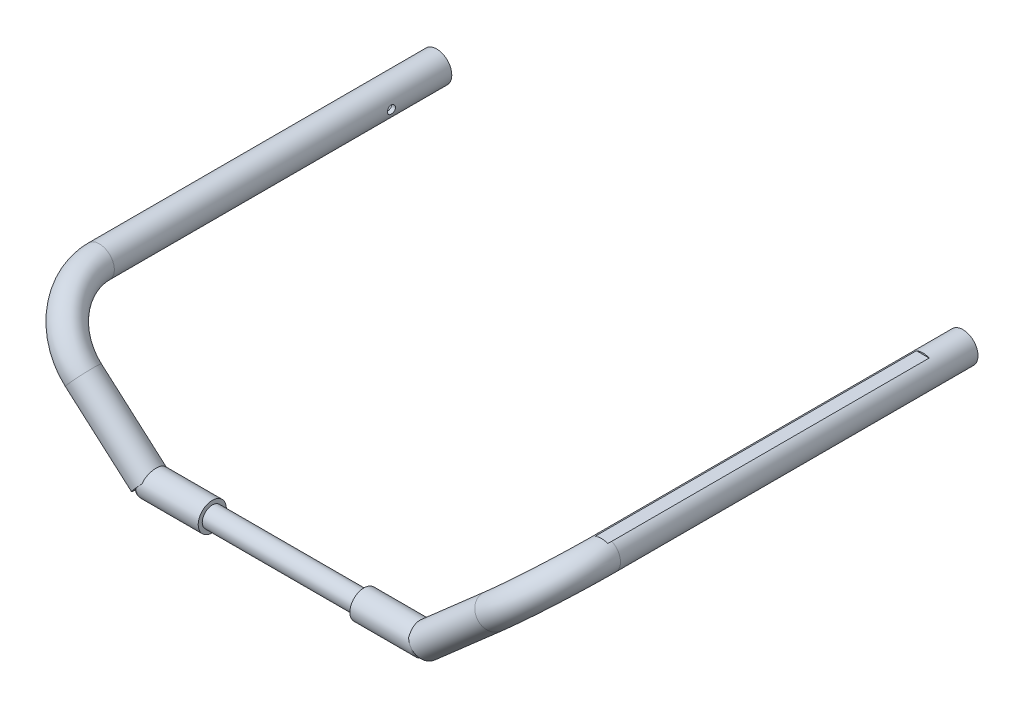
ISO-10303-21;
HEADER;
FILE_DESCRIPTION(('STEP AP214'),'2;1');
FILE_NAME('part.step','',(''),(''),'','','');
FILE_SCHEMA(('AUTOMOTIVE_DESIGN { 1 0 10303 214 1 1 1 1 }'));
ENDSEC;
DATA;
#1=APPLICATION_CONTEXT('core data for automotive mechanical design processes');
#2=APPLICATION_PROTOCOL_DEFINITION('international standard','automotive_design',2000,#1);
#3=PRODUCT_CONTEXT('',#1,'mechanical');
#4=PRODUCT('Part','Part','',(#3));
#5=PRODUCT_RELATED_PRODUCT_CATEGORY('part','',(#4));
#6=PRODUCT_DEFINITION_FORMATION('','',#4);
#7=PRODUCT_DEFINITION_CONTEXT('part definition',#1,'design');
#8=PRODUCT_DEFINITION('design','',#6,#7);
#9=PRODUCT_DEFINITION_SHAPE('','',#8);
#10=(LENGTH_UNIT() NAMED_UNIT(*) SI_UNIT(.MILLI.,.METRE.));
#11=(NAMED_UNIT(*) PLANE_ANGLE_UNIT() SI_UNIT($,.RADIAN.));
#12=(NAMED_UNIT(*) SI_UNIT($,.STERADIAN.) SOLID_ANGLE_UNIT());
#13=UNCERTAINTY_MEASURE_WITH_UNIT(LENGTH_MEASURE(1.E-05),#10,'distance_accuracy_value','');
#14=(GEOMETRIC_REPRESENTATION_CONTEXT(3) GLOBAL_UNCERTAINTY_ASSIGNED_CONTEXT((#13)) GLOBAL_UNIT_ASSIGNED_CONTEXT((#10,
#11,#12)) REPRESENTATION_CONTEXT('',''));
#15=CARTESIAN_POINT('',(0.,0.,0.));
#16=DIRECTION('',(0.,0.,1.));
#17=DIRECTION('',(1.,0.,0.));
#18=AXIS2_PLACEMENT_3D('',#15,#16,#17);
#19=CARTESIAN_POINT('',(126.,50.,-210.));
#20=DIRECTION('',(0.,0.,-1.));
#21=DIRECTION('',(0.,1.,0.));
#22=AXIS2_PLACEMENT_3D('',#19,#20,#21);
#23=PLANE('',#22);
#24=CARTESIAN_POINT('',(126.,49.9999999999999,-210.));
#25=DIRECTION('',(0.,0.,-1.));
#26=DIRECTION('',(0.,1.,0.));
#27=AXIS2_PLACEMENT_3D('',#24,#25,#26);
#28=CIRCLE('',#27,7.5);
#29=CARTESIAN_POINT('',(126.,57.4999999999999,-210.));
#30=VERTEX_POINT('',#29);
#31=EDGE_CURVE('E110',#30,#30,#28,.F.);
#32=ORIENTED_EDGE('',*,*,#31,.F.);
#33=EDGE_LOOP('',(#32));
#34=FACE_BOUND('',#33,.T.);
#35=CARTESIAN_POINT('',(126.,49.9999999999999,-210.));
#36=DIRECTION('',(0.,0.,-1.));
#37=DIRECTION('',(0.,1.,0.));
#38=AXIS2_PLACEMENT_3D('',#35,#36,#37);
#39=CIRCLE('',#38,5.5);
#40=CARTESIAN_POINT('',(126.,55.4999999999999,-210.));
#41=VERTEX_POINT('',#40);
#42=EDGE_CURVE('E131',#41,#41,#39,.F.);
#43=ORIENTED_EDGE('',*,*,#42,.T.);
#44=EDGE_LOOP('',(#43));
#45=FACE_BOUND('',#44,.T.);
#46=ADVANCED_FACE('F17',(#34,#45),#23,.T.);
#47=CARTESIAN_POINT('',(136.,66.8,-190.));
#48=DIRECTION('',(0.,0.,1.));
#49=DIRECTION('',(1.,0.,0.));
#50=AXIS2_PLACEMENT_3D('',#47,#48,#49);
#51=PLANE('',#50);
#52=CARTESIAN_POINT('',(126.,50.,-190.));
#53=DIRECTION('',(0.,0.,-1.));
#54=DIRECTION('',(0.,1.,0.));
#55=AXIS2_PLACEMENT_3D('',#52,#53,#54);
#56=CIRCLE('',#55,7.5);
#57=CARTESIAN_POINT('',(122.836141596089,56.8,-190.));
#58=VERTEX_POINT('',#57);
#59=CARTESIAN_POINT('',(129.163858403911,56.8,-190.));
#60=VERTEX_POINT('',#59);
#61=EDGE_CURVE('E104',#58,#60,#56,.T.);
#62=ORIENTED_EDGE('',*,*,#61,.F.);
#63=DIRECTION('',(1.,0.,0.));
#64=VECTOR('',#63,1.);
#65=CARTESIAN_POINT('',(136.,56.8,-190.));
#66=LINE('',#65,#64);
#67=EDGE_CURVE('E101',#60,#58,#66,.F.);
#68=ORIENTED_EDGE('',*,*,#67,.F.);
#69=EDGE_LOOP('',(#62,#68));
#70=FACE_BOUND('',#69,.T.);
#71=ADVANCED_FACE('F105',(#70),#51,.T.);
#72=CARTESIAN_POINT('',(126.,50.,-32.));
#73=DIRECTION('',(0.,0.,-1.));
#74=DIRECTION('',(0.,1.,0.));
#75=AXIS2_PLACEMENT_3D('',#72,#73,#74);
#76=CYLINDRICAL_SURFACE('',#75,5.5);
#77=ORIENTED_EDGE('',*,*,#42,.F.);
#78=EDGE_LOOP('',(#77));
#79=FACE_BOUND('',#78,.T.);
#80=CARTESIAN_POINT('',(126.,50.,-32.));
#81=DIRECTION('',(0.,0.,-1.));
#82=DIRECTION('',(0.751759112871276,0.659437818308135,0.));
#83=AXIS2_PLACEMENT_3D('',#80,#81,#82);
#84=CIRCLE('',#83,5.5);
#85=CARTESIAN_POINT('',(130.134675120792,53.6269080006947,-32.));
#86=VERTEX_POINT('',#85);
#87=EDGE_CURVE('E133',#86,#86,#84,.F.);
#88=ORIENTED_EDGE('',*,*,#87,.T.);
#89=EDGE_LOOP('',(#88));
#90=FACE_BOUND('',#89,.T.);
#91=ADVANCED_FACE('F811',(#79,#90),#76,.F.);
#92=CARTESIAN_POINT('',(136.,66.8,-30.));
#93=DIRECTION('',(0.,0.,-1.));
#94=DIRECTION('',(-1.,0.,0.));
#95=AXIS2_PLACEMENT_3D('',#92,#93,#94);
#96=PLANE('',#95);
#97=DIRECTION('',(1.,0.,0.));
#98=VECTOR('',#97,1.);
#99=CARTESIAN_POINT('',(136.,56.8,-30.));
#100=LINE('',#99,#98);
#101=CARTESIAN_POINT('',(122.876461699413,56.8,-30.));
#102=VERTEX_POINT('',#101);
#103=CARTESIAN_POINT('',(129.051010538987,56.8,-30.));
#104=VERTEX_POINT('',#103);
#105=EDGE_CURVE('E119',#102,#104,#100,.T.);
#106=ORIENTED_EDGE('',*,*,#105,.F.);
#107=CARTESIAN_POINT('',(129.051010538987,56.8,-30.));
#108=CARTESIAN_POINT('',(128.858796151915,56.886812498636,-30.));
#109=CARTESIAN_POINT('',(128.662903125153,56.9654685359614,-30.));
#110=CARTESIAN_POINT('',(128.265194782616,57.1060043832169,-30.));
#111=CARTESIAN_POINT('',(128.063379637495,57.167884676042,-30.));
#112=CARTESIAN_POINT('',(127.655271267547,57.2744054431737,-30.));
#113=CARTESIAN_POINT('',(127.448978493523,57.3190476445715,-30.));
#114=CARTESIAN_POINT('',(127.033373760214,57.3907943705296,-30.));
#115=CARTESIAN_POINT('',(126.824061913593,57.4178995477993,-30.));
#116=CARTESIAN_POINT('',(126.403751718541,57.4543991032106,-30.));
#117=CARTESIAN_POINT('',(126.192752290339,57.463781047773,-30.));
#118=CARTESIAN_POINT('',(125.770713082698,57.4647368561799,-30.));
#119=CARTESIAN_POINT('',(125.559673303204,57.4563106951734,-30.));
#120=CARTESIAN_POINT('',(125.139298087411,57.4217363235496,-30.));
#121=CARTESIAN_POINT('',(124.929960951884,57.3956087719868,-30.));
#122=CARTESIAN_POINT('',(124.514297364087,57.3258596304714,-30.));
#123=CARTESIAN_POINT('',(124.307969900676,57.2822440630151,-30.));
#124=CARTESIAN_POINT('',(123.893446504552,57.1762237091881,-30.));
#125=CARTESIAN_POINT('',(123.685387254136,57.1132838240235,-30.));
#126=CARTESIAN_POINT('',(123.275752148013,56.9697468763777,-30.));
#127=CARTESIAN_POINT('',(123.074168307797,56.8891725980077,-30.));
#128=CARTESIAN_POINT('',(122.876461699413,56.8,-30.));
#129=B_SPLINE_CURVE_WITH_KNOTS('',3,(#107,#108,#109,#110,#111,#112,#113,#114,#115,#116,#117,
#118,#119,#120,#121,#122,#123,#124,#125,#126,#127,#128),.UNSPECIFIED.,.F.,.F.,(4,2,2,2,2,2,2,2,
2,2,4),(0.,0.63253412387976,1.26505003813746,1.89750256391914,2.52993154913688,3.16280404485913,
3.7956774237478,4.42781345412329,5.05973197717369,5.7110259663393,6.36148338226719),.UNSPECIFIED.);
#130=EDGE_CURVE('E435',#104,#102,#129,.T.);
#131=ORIENTED_EDGE('',*,*,#130,.F.);
#132=EDGE_LOOP('',(#106,#131));
#133=FACE_BOUND('',#132,.T.);
#134=ADVANCED_FACE('F425',(#133),#96,.T.);
#135=CARTESIAN_POINT('',(136.,56.8,-190.));
#136=DIRECTION('',(0.,1.,0.));
#137=DIRECTION('',(0.,0.,1.));
#138=AXIS2_PLACEMENT_3D('',#135,#136,#137);
#139=PLANE('',#138);
#140=ORIENTED_EDGE('',*,*,#67,.T.);
#141=DIRECTION('',(0.,0.,-1.));
#142=VECTOR('',#141,1.);
#143=CARTESIAN_POINT('',(122.836141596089,56.8,-32.));
#144=LINE('',#143,#142);
#145=CARTESIAN_POINT('',(122.836141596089,56.8,-32.));
#146=VERTEX_POINT('',#145);
#147=EDGE_CURVE('E116',#146,#58,#144,.T.);
#148=ORIENTED_EDGE('',*,*,#147,.F.);
#149=CARTESIAN_POINT('',(122.876461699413,56.8,-30.));
#150=CARTESIAN_POINT('',(122.871838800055,56.8,-30.1110547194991));
#151=CARTESIAN_POINT('',(122.867647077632,56.8,-30.2221270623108));
#152=CARTESIAN_POINT('',(122.860087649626,56.8,-30.4442889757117));
#153=CARTESIAN_POINT('',(122.856719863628,56.8,-30.55537854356));
#154=CARTESIAN_POINT('',(122.8507692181,56.8,-30.777573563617));
#155=CARTESIAN_POINT('',(122.848186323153,56.8,-30.8886790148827));
#156=CARTESIAN_POINT('',(122.843778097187,56.8,-31.1109044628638));
#157=CARTESIAN_POINT('',(122.841952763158,56.8,-31.2220244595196));
#158=CARTESIAN_POINT('',(122.839039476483,56.8,-31.4442795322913));
#159=CARTESIAN_POINT('',(122.837951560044,56.8,-31.5554146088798));
#160=CARTESIAN_POINT('',(122.836503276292,56.8,-31.7776998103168));
#161=CARTESIAN_POINT('',(122.836142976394,56.8,-31.8888499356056));
#162=CARTESIAN_POINT('',(122.836141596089,56.8,-32.));
#163=B_SPLINE_CURVE_WITH_KNOTS('',3,(#149,#150,#151,#152,#153,#154,#155,#156,#157,#158,#159,
#160,#161,#162),.UNSPECIFIED.,.F.,.F.,(4,2,2,2,2,2,4),(0.,0.333451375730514,0.66687019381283,
1.0002739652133,1.33367641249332,1.66709522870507,2.00054493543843),.UNSPECIFIED.);
#164=EDGE_CURVE('E372',#102,#146,#163,.T.);
#165=ORIENTED_EDGE('',*,*,#164,.F.);
#166=ORIENTED_EDGE('',*,*,#105,.T.);
#167=CARTESIAN_POINT('',(129.163858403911,56.8,-32.0000000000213));
#168=CARTESIAN_POINT('',(129.163858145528,56.8,-31.9164311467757));
#169=CARTESIAN_POINT('',(129.163273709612,56.8,-31.8328622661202));
#170=CARTESIAN_POINT('',(129.160935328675,56.8,-31.6657908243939));
#171=CARTESIAN_POINT('',(129.159182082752,56.8,-31.5822882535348));
#172=CARTESIAN_POINT('',(129.154505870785,56.8,-31.4153494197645));
#173=CARTESIAN_POINT('',(129.151583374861,56.8,-31.3319131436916));
#174=CARTESIAN_POINT('',(129.144565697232,56.8,-31.165106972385));
#175=CARTESIAN_POINT('',(129.140470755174,56.8,-31.0817370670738));
#176=CARTESIAN_POINT('',(129.131102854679,56.8,-30.9150627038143));
#177=CARTESIAN_POINT('',(129.125829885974,56.8,-30.831758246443));
#178=CARTESIAN_POINT('',(129.114098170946,56.8,-30.6652163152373));
#179=CARTESIAN_POINT('',(129.107639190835,56.8,-30.581978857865));
#180=CARTESIAN_POINT('',(129.093525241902,56.8,-30.4155717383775));
#181=CARTESIAN_POINT('',(129.085869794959,56.8,-30.3324021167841));
#182=CARTESIAN_POINT('',(129.069349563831,56.8,-30.1661318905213));
#183=CARTESIAN_POINT('',(129.060484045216,56.8,-30.0830313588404));
#184=CARTESIAN_POINT('',(129.051010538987,56.8,-30.));
#185=B_SPLINE_CURVE_WITH_KNOTS('',3,(#167,#168,#169,#170,#171,#172,#173,#174,#175,#176,#177,
#178,#179,#180,#181,#182,#183,#184),.UNSPECIFIED.,.F.,.F.,(4,2,2,2,2,2,2,2,4),(0.,
0.250704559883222,0.501259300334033,0.751713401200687,1.00211634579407,1.25252147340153,
1.50297601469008,1.7535308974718,2.00423853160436),.UNSPECIFIED.);
#186=CARTESIAN_POINT('',(129.163858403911,56.8,-32.0000000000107));
#187=VERTEX_POINT('',#186);
#188=EDGE_CURVE('E135',#187,#104,#185,.T.);
#189=ORIENTED_EDGE('',*,*,#188,.F.);
#190=DIRECTION('',(0.,0.,-1.));
#191=VECTOR('',#190,1.);
#192=CARTESIAN_POINT('',(129.163858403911,56.8,-32.));
#193=LINE('',#192,#191);
#194=EDGE_CURVE('E109',#60,#187,#193,.F.);
#195=ORIENTED_EDGE('',*,*,#194,.F.);
#196=EDGE_LOOP('',(#140,#148,#165,#166,#189,#195));
#197=FACE_BOUND('',#196,.T.);
#198=ADVANCED_FACE('F114',(#197),#139,.T.);
#199=CARTESIAN_POINT('',(126.,50.,-32.));
#200=DIRECTION('',(0.,0.,-1.));
#201=DIRECTION('',(0.,1.,0.));
#202=AXIS2_PLACEMENT_3D('',#199,#200,#201);
#203=CYLINDRICAL_SURFACE('',#202,7.5);
#204=ORIENTED_EDGE('',*,*,#31,.T.);
#205=EDGE_LOOP('',(#204));
#206=FACE_BOUND('',#205,.T.);
#207=ORIENTED_EDGE('',*,*,#61,.T.);
#208=ORIENTED_EDGE('',*,*,#194,.T.);
#209=CARTESIAN_POINT('',(126.,50.,-32.));
#210=DIRECTION('',(0.,0.,-1.));
#211=DIRECTION('',(0.751759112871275,0.659437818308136,0.));
#212=AXIS2_PLACEMENT_3D('',#209,#210,#211);
#213=CIRCLE('',#212,7.5);
#214=EDGE_CURVE('E122',#146,#187,#213,.F.);
#215=ORIENTED_EDGE('',*,*,#214,.F.);
#216=ORIENTED_EDGE('',*,*,#147,.T.);
#217=EDGE_LOOP('',(#207,#208,#215,#216));
#218=FACE_BOUND('',#217,.T.);
#219=ADVANCED_FACE('F121',(#206,#218),#203,.T.);
#220=CARTESIAN_POINT('',(101.943708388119,28.8979898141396,-32.));
#221=DIRECTION('',(-0.659437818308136,0.751759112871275,0.));
#222=DIRECTION('',(-0.751759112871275,-0.659437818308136,0.));
#223=AXIS2_PLACEMENT_3D('',#220,#221,#222);
#224=TOROIDAL_SURFACE('',#223,32.,5.5);
#225=CARTESIAN_POINT('',(101.943708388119,28.8979898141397,0.));
#226=DIRECTION('',(-0.751759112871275,-0.659437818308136,0.));
#227=DIRECTION('',(0.659437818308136,-0.751759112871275,0.));
#228=AXIS2_PLACEMENT_3D('',#225,#226,#227);
#229=CIRCLE('',#228,5.5);
#230=CARTESIAN_POINT('',(105.570616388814,24.7633146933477,0.));
#231=VERTEX_POINT('',#230);
#232=EDGE_CURVE('E358',#231,#231,#229,.T.);
#233=ORIENTED_EDGE('',*,*,#232,.T.);
#234=EDGE_LOOP('',(#233));
#235=FACE_BOUND('',#234,.T.);
#236=ORIENTED_EDGE('',*,*,#87,.F.);
#237=EDGE_LOOP('',(#236));
#238=FACE_BOUND('',#237,.T.);
#239=ADVANCED_FACE('F416',(#235,#238),#224,.F.);
#240=CARTESIAN_POINT('',(68.5,0.,0.));
#241=DIRECTION('',(1.,0.,0.));
#242=DIRECTION('',(0.,0.,-1.));
#243=AXIS2_PLACEMENT_3D('',#240,#241,#242);
#244=TOROIDAL_SURFACE('',#243,5.5,1.5);
#245=CARTESIAN_POINT('',(70.,0.,0.));
#246=DIRECTION('',(-1.,0.,0.));
#247=DIRECTION('',(0.,0.0684442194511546,0.997654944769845));
#248=AXIS2_PLACEMENT_3D('',#245,#246,#247);
#249=CIRCLE('',#248,5.49999999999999);
#250=CARTESIAN_POINT('',(70.,0.376443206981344,-5.48710219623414));
#251=VERTEX_POINT('',#250);
#252=CARTESIAN_POINT('',(70.,0.376443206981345,5.48710219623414));
#253=VERTEX_POINT('',#252);
#254=EDGE_CURVE('E352',#251,#253,#249,.F.);
#255=ORIENTED_EDGE('',*,*,#254,.F.);
#256=CARTESIAN_POINT('',(70.,0.376443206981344,-5.48710219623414));
#257=CARTESIAN_POINT('',(69.9999781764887,0.54488874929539,-5.49575333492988));
#258=CARTESIAN_POINT('',(69.9995945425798,0.713581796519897,-5.50010134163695));
#259=CARTESIAN_POINT('',(69.9971019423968,1.05175145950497,-5.49989379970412));
#260=CARTESIAN_POINT('',(69.9949847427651,1.22122796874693,-5.49529561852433));
#261=CARTESIAN_POINT('',(69.9879983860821,1.55992406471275,-5.47679400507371));
#262=CARTESIAN_POINT('',(69.9831245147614,1.72914271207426,-5.46287462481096));
#263=CARTESIAN_POINT('',(69.9695063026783,2.06820327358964,-5.42493295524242));
#264=CARTESIAN_POINT('',(69.9607198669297,2.23803147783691,-5.4008009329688));
#265=CARTESIAN_POINT('',(69.9383704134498,2.5752353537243,-5.34171463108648));
#266=CARTESIAN_POINT('',(69.9248147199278,2.7426143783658,-5.30677695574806));
#267=CARTESIAN_POINT('',(69.8923099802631,3.07381598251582,-5.22526871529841));
#268=CARTESIAN_POINT('',(69.873367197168,3.23764245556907,-5.17871166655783));
#269=CARTESIAN_POINT('',(69.8327256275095,3.53908757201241,-5.08014722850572));
#270=CARTESIAN_POINT('',(69.8117244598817,3.6773028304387,-5.0296791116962));
#271=CARTESIAN_POINT('',(69.7655784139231,3.94906826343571,-4.91894794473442));
#272=CARTESIAN_POINT('',(69.7404333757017,4.08261825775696,-4.85868451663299));
#273=CARTESIAN_POINT('',(69.6864717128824,4.34330268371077,-4.72840225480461));
#274=CARTESIAN_POINT('',(69.6576729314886,4.47046435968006,-4.65843068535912));
#275=CARTESIAN_POINT('',(69.5968753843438,4.71792688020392,-4.50844726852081));
#276=CARTESIAN_POINT('',(69.564876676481,4.83822784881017,-4.42843560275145));
#277=CARTESIAN_POINT('',(69.4982320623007,5.07159982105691,-4.2580127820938));
#278=CARTESIAN_POINT('',(69.4635716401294,5.18462393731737,-4.16754300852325));
#279=CARTESIAN_POINT('',(69.3926788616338,5.40169940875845,-3.97695749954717));
#280=CARTESIAN_POINT('',(69.3564464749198,5.50575059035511,-3.87684157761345));
#281=CARTESIAN_POINT('',(69.2833661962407,5.70421104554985,-3.66740032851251));
#282=CARTESIAN_POINT('',(69.2465175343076,5.79860701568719,-3.55806266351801));
#283=CARTESIAN_POINT('',(69.1733137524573,5.97698223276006,-3.33105014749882));
#284=CARTESIAN_POINT('',(69.1369586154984,6.06096184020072,-3.21337558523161));
#285=CARTESIAN_POINT('',(69.0677449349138,6.21383656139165,-2.97716784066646));
#286=CARTESIAN_POINT('',(69.0348037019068,6.28330292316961,-2.85902772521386));
#287=CARTESIAN_POINT('',(68.9711989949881,6.41241215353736,-2.61685815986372));
#288=CARTESIAN_POINT('',(68.9405363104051,6.47205162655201,-2.4928266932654));
#289=CARTESIAN_POINT('',(68.8823707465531,6.58142495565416,-2.23983049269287));
#290=CARTESIAN_POINT('',(68.8548664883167,6.63116314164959,-2.11086794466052));
#291=CARTESIAN_POINT('',(68.8038020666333,6.72086156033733,-1.84882682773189));
#292=CARTESIAN_POINT('',(68.7802419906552,6.76082157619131,-1.71574816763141));
#293=CARTESIAN_POINT('',(68.7388587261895,6.82936656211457,-1.45313586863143));
#294=CARTESIAN_POINT('',(68.720806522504,6.85842272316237,-1.32376078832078));
#295=CARTESIAN_POINT('',(68.6894454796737,6.90804639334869,-1.06286534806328));
#296=CARTESIAN_POINT('',(68.6761352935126,6.92861631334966,-0.931345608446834));
#297=CARTESIAN_POINT('',(68.6546653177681,6.96144390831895,-0.666881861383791));
#298=CARTESIAN_POINT('',(68.6465046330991,6.97370302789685,-0.533938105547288));
#299=CARTESIAN_POINT('',(68.63559373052,6.99003403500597,-0.267328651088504));
#300=CARTESIAN_POINT('',(68.6328434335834,6.99410604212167,-0.133662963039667));
#301=CARTESIAN_POINT('',(68.6328429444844,6.99410592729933,0.126598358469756));
#302=CARTESIAN_POINT('',(68.635309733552,6.9904528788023,0.253194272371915));
#303=CARTESIAN_POINT('',(68.6451043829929,6.97580404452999,0.505808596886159));
#304=CARTESIAN_POINT('',(68.6524335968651,6.96480621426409,0.631826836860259));
#305=CARTESIAN_POINT('',(68.6717449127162,6.93536436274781,0.88266927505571));
#306=CARTESIAN_POINT('',(68.6837283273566,6.91691824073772,1.00749312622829));
#307=CARTESIAN_POINT('',(68.7120117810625,6.87244185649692,1.25528841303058));
#308=CARTESIAN_POINT('',(68.7283119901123,6.84641129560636,1.37825977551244));
#309=CARTESIAN_POINT('',(68.7685449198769,6.78046878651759,1.64672401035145));
#310=CARTESIAN_POINT('',(68.7933574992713,6.73880437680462,1.79165971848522));
#311=CARTESIAN_POINT('',(68.8477287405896,6.64399200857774,2.07682727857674));
#312=CARTESIAN_POINT('',(68.8772879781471,6.59084265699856,2.21705855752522));
#313=CARTESIAN_POINT('',(68.940136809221,6.47293093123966,2.49169781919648));
#314=CARTESIAN_POINT('',(68.9734265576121,6.40816807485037,2.62610555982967));
#315=CARTESIAN_POINT('',(69.0426421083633,6.26707110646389,2.8879851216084));
#316=CARTESIAN_POINT('',(69.0785677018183,6.19073791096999,3.01545749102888));
#317=CARTESIAN_POINT('',(69.1503764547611,6.03018755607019,3.25724609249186));
#318=CARTESIAN_POINT('',(69.1861980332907,5.94643612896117,3.37189001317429));
#319=CARTESIAN_POINT('',(69.2582006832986,5.7689424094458,3.59304244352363));
#320=CARTESIAN_POINT('',(69.2943817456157,5.67520037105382,3.69955115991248));
#321=CARTESIAN_POINT('',(69.3660838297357,5.47837389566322,3.90368394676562));
#322=CARTESIAN_POINT('',(69.4016051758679,5.37529420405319,4.00131248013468));
#323=CARTESIAN_POINT('',(69.4710573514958,5.16052801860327,4.18721296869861));
#324=CARTESIAN_POINT('',(69.5049882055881,5.0488416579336,4.27548506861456));
#325=CARTESIAN_POINT('',(69.5691549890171,4.82220165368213,4.43914855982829));
#326=CARTESIAN_POINT('',(69.5994825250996,4.70753551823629,4.51490303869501));
#327=CARTESIAN_POINT('',(69.6572356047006,4.47201559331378,4.65732673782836));
#328=CARTESIAN_POINT('',(69.6846612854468,4.35116209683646,4.72399638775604));
#329=CARTESIAN_POINT('',(69.7361336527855,4.10417869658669,4.84833472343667));
#330=CARTESIAN_POINT('',(69.760179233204,3.978047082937,4.90600046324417));
#331=CARTESIAN_POINT('',(69.8045823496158,3.72148214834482,5.0125347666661));
#332=CARTESIAN_POINT('',(69.8249390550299,3.59104786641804,5.06140134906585));
#333=CARTESIAN_POINT('',(69.8693525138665,3.27299061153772,5.16884635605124));
#334=CARTESIAN_POINT('',(69.8915429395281,3.08369883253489,5.22328238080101));
#335=CARTESIAN_POINT('',(69.9287156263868,2.7006138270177,5.31662763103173));
#336=CARTESIAN_POINT('',(69.9436942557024,2.50681838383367,5.3555290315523));
#337=CARTESIAN_POINT('',(69.9674859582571,2.11625553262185,5.4191256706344));
#338=CARTESIAN_POINT('',(69.97628886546,1.91948376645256,5.44379747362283));
#339=CARTESIAN_POINT('',(69.9891856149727,1.52467633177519,5.47993671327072));
#340=CARTESIAN_POINT('',(69.9932811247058,1.32664113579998,5.49140882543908));
#341=CARTESIAN_POINT('',(69.9975025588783,1.00285579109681,5.49998974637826));
#342=CARTESIAN_POINT('',(69.9985330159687,0.877198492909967,5.50082050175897));
#343=CARTESIAN_POINT('',(69.9997758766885,0.626468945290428,5.497583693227));
#344=CARTESIAN_POINT('',(69.9999916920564,0.501396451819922,5.49353665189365));
#345=CARTESIAN_POINT('',(70.,0.376443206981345,5.48710219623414));
#346=B_SPLINE_CURVE_WITH_KNOTS('',3,(#256,#257,#258,#259,#260,#261,#262,#263,#264,#265,#266,
#267,#268,#269,#270,#271,#272,#273,#274,#275,#276,#277,#278,#279,#280,#281,#282,#283,#284,#285,
#286,#287,#288,#289,#290,#291,#292,#293,#294,#295,#296,#297,#298,#299,#300,#301,#302,#303,#304,
#305,#306,#307,#308,#309,#310,#311,#312,#313,#314,#315,#316,#317,#318,#319,#320,#321,#322,#323,
#324,#325,#326,#327,#328,#329,#330,#331,#332,#333,#334,#335,#336,#337,#338,#339,#340,#341,#342,
#343,#344,#345),.UNSPECIFIED.,.F.,.F.,(4,2,2,2,2,2,2,2,2,2,2,2,2,2,2,2,2,2,2,2,2,2,2,2,2,2,2,2,
2,2,2,2,2,2,2,2,2,2,2,2,2,2,2,2,4),(0.,0.505987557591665,1.01439227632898,1.52366907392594,
2.03856274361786,2.55266911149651,3.06618020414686,3.51165872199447,3.95715443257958,
4.40055274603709,4.84394303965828,5.2899515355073,5.73596865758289,6.18259227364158,
6.62920042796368,7.05157474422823,7.47409470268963,7.89642948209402,8.31877362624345,
8.71986647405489,9.12084529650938,9.52175440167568,9.92265765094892,10.3023716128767,
10.6821913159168,11.0621182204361,11.4420600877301,11.8999744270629,12.357944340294,
12.815933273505,13.2738859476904,13.7126060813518,14.1513150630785,14.5898023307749,
15.0282828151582,15.4500237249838,15.8717446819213,16.2936033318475,16.7155568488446,
17.3092513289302,17.9032444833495,18.4982131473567,19.0929710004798,19.4698743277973,
19.8451974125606),.UNSPECIFIED.);
#347=EDGE_CURVE('E361',#251,#253,#346,.T.);
#348=ORIENTED_EDGE('',*,*,#347,.T.);
#349=EDGE_LOOP('',(#255,#348));
#350=FACE_BOUND('',#349,.T.);
#351=ADVANCED_FACE('F380',(#350),#244,.T.);
#352=CARTESIAN_POINT('',(101.943708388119,28.8979898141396,-32.));
#353=DIRECTION('',(-0.659437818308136,0.751759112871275,0.));
#354=DIRECTION('',(-0.751759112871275,-0.659437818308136,0.));
#355=AXIS2_PLACEMENT_3D('',#352,#353,#354);
#356=TOROIDAL_SURFACE('',#355,32.,7.5);
#357=CARTESIAN_POINT('',(101.943708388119,28.8979898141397,0.));
#358=DIRECTION('',(-0.751759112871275,-0.659437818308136,0.));
#359=DIRECTION('',(0.659437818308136,-0.751759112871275,0.));
#360=AXIS2_PLACEMENT_3D('',#357,#358,#359);
#361=CIRCLE('',#360,7.5);
#362=CARTESIAN_POINT('',(106.88949202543,23.2597964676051,0.));
#363=VERTEX_POINT('',#362);
#364=EDGE_CURVE('E351',#363,#363,#361,.T.);
#365=ORIENTED_EDGE('',*,*,#364,.F.);
#366=EDGE_LOOP('',(#365));
#367=FACE_BOUND('',#366,.T.);
#368=ORIENTED_EDGE('',*,*,#164,.T.);
#369=ORIENTED_EDGE('',*,*,#214,.T.);
#370=ORIENTED_EDGE('',*,*,#188,.T.);
#371=ORIENTED_EDGE('',*,*,#130,.T.);
#372=EDGE_LOOP('',(#368,#369,#370,#371));
#373=FACE_BOUND('',#372,.T.);
#374=ADVANCED_FACE('F389',(#367,#373),#356,.T.);
#375=CARTESIAN_POINT('',(101.943708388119,28.8979898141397,0.));
#376=DIRECTION('',(-0.751759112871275,-0.659437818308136,0.));
#377=DIRECTION('',(0.659437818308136,-0.751759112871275,0.));
#378=AXIS2_PLACEMENT_3D('',#375,#376,#377);
#379=CYLINDRICAL_SURFACE('',#378,5.5);
#380=ORIENTED_EDGE('',*,*,#232,.F.);
#381=EDGE_LOOP('',(#380));
#382=FACE_BOUND('',#381,.T.);
#383=CARTESIAN_POINT('',(70.,0.877192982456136,0.));
#384=DIRECTION('',(1.,0.,0.));
#385=DIRECTION('',(0.,-1.,0.));
#386=AXIS2_PLACEMENT_3D('',#383,#384,#385);
#387=ELLIPSE('',#386,7.31617336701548,5.5);
#388=CARTESIAN_POINT('',(70.,-1.14000000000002,-5.28681378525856));
#389=VERTEX_POINT('',#388);
#390=EDGE_CURVE('E355',#389,#251,#387,.T.);
#391=ORIENTED_EDGE('',*,*,#390,.F.);
#392=CARTESIAN_POINT('',(69.,0.,0.));
#393=DIRECTION('',(-0.751759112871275,-0.659437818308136,0.));
#394=DIRECTION('',(0.659437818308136,-0.751759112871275,0.));
#395=AXIS2_PLACEMENT_3D('',#392,#393,#394);
#396=CIRCLE('',#395,5.5);
#397=CARTESIAN_POINT('',(70.,-1.14,5.28681378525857));
#398=VERTEX_POINT('',#397);
#399=EDGE_CURVE('E345',#389,#398,#396,.T.);
#400=ORIENTED_EDGE('',*,*,#399,.T.);
#401=CARTESIAN_POINT('',(70.,0.877192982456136,0.));
#402=DIRECTION('',(1.,0.,0.));
#403=DIRECTION('',(0.,-1.,0.));
#404=AXIS2_PLACEMENT_3D('',#401,#402,#403);
#405=ELLIPSE('',#404,7.31617336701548,5.5);
#406=EDGE_CURVE('E348',#253,#398,#405,.T.);
#407=ORIENTED_EDGE('',*,*,#406,.F.);
#408=ORIENTED_EDGE('',*,*,#347,.F.);
#409=EDGE_LOOP('',(#391,#400,#407,#408));
#410=FACE_BOUND('',#409,.T.);
#411=ADVANCED_FACE('F384',(#382,#410),#379,.F.);
#412=CARTESIAN_POINT('',(70.,0.,0.));
#413=DIRECTION('',(1.,0.,0.));
#414=DIRECTION('',(0.,0.,-1.));
#415=AXIS2_PLACEMENT_3D('',#412,#413,#414);
#416=PLANE('',#415);
#417=CARTESIAN_POINT('',(70.,0.,0.));
#418=DIRECTION('',(-1.,0.,0.));
#419=DIRECTION('',(0.,-0.207272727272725,-0.978283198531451));
#420=AXIS2_PLACEMENT_3D('',#417,#418,#419);
#421=CIRCLE('',#420,5.5);
#422=CARTESIAN_POINT('',(70.,-1.13999999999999,-5.38055759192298));
#423=VERTEX_POINT('',#422);
#424=CARTESIAN_POINT('',(70.0000000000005,-1.14000000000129,5.38055759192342));
#425=VERTEX_POINT('',#424);
#426=EDGE_CURVE('E336',#423,#425,#421,.T.);
#427=ORIENTED_EDGE('',*,*,#426,.F.);
#428=DIRECTION('',(0.,0.,1.));
#429=VECTOR('',#428,1.);
#430=CARTESIAN_POINT('',(70.,-1.13999999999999,0.));
#431=LINE('',#430,#429);
#432=EDGE_CURVE('E347',#423,#389,#431,.T.);
#433=ORIENTED_EDGE('',*,*,#432,.T.);
#434=ORIENTED_EDGE('',*,*,#390,.T.);
#435=ORIENTED_EDGE('',*,*,#254,.T.);
#436=ORIENTED_EDGE('',*,*,#406,.T.);
#437=DIRECTION('',(0.,0.,1.));
#438=VECTOR('',#437,1.);
#439=CARTESIAN_POINT('',(70.,-1.13999999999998,0.));
#440=LINE('',#439,#438);
#441=EDGE_CURVE('E301',#398,#425,#440,.T.);
#442=ORIENTED_EDGE('',*,*,#441,.T.);
#443=EDGE_LOOP('',(#427,#433,#434,#435,#436,#442));
#444=FACE_BOUND('',#443,.T.);
#445=ADVANCED_FACE('F388',(#444),#416,.T.);
#446=CARTESIAN_POINT('',(101.943708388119,28.8979898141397,0.));
#447=DIRECTION('',(-0.751759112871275,-0.659437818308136,0.));
#448=DIRECTION('',(0.659437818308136,-0.751759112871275,0.));
#449=AXIS2_PLACEMENT_3D('',#446,#447,#448);
#450=CYLINDRICAL_SURFACE('',#449,7.5);
#451=ORIENTED_EDGE('',*,*,#364,.T.);
#452=EDGE_LOOP('',(#451));
#453=FACE_BOUND('',#452,.T.);
#454=CARTESIAN_POINT('',(69.,0.,0.));
#455=DIRECTION('',(-0.751759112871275,-0.659437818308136,0.));
#456=DIRECTION('',(0.659437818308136,-0.751759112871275,0.));
#457=AXIS2_PLACEMENT_3D('',#454,#455,#456);
#458=CIRCLE('',#457,7.5);
#459=CARTESIAN_POINT('',(66.3074175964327,3.06954394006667,6.29109688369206));
#460=VERTEX_POINT('',#459);
#461=CARTESIAN_POINT('',(66.3074175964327,3.06954394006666,-6.29109688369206));
#462=VERTEX_POINT('',#461);
#463=EDGE_CURVE('E337',#460,#462,#458,.F.);
#464=ORIENTED_EDGE('',*,*,#463,.T.);
#465=CARTESIAN_POINT('',(66.3074175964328,3.06954394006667,6.29109688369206));
#466=CARTESIAN_POINT('',(66.307399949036,3.15552385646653,6.24914869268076));
#467=CARTESIAN_POINT('',(66.3056267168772,3.24062138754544,6.20544294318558));
#468=CARTESIAN_POINT('',(66.2991671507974,3.4088422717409,6.11464768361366));
#469=CARTESIAN_POINT('',(66.2944818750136,3.49196633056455,6.06755940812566));
#470=CARTESIAN_POINT('',(66.2828026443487,3.65599196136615,5.97016015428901));
#471=CARTESIAN_POINT('',(66.2758115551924,3.73689615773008,5.91985323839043));
#472=CARTESIAN_POINT('',(66.2599945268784,3.89646150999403,5.81606814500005));
#473=CARTESIAN_POINT('',(66.2511684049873,3.97512244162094,5.76258965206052));
#474=CARTESIAN_POINT('',(66.2226130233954,4.20719852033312,5.59780437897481));
#475=CARTESIAN_POINT('',(66.2007725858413,4.35712564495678,5.4818988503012));
#476=CARTESIAN_POINT('',(66.1539970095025,4.64683983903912,5.23857714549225));
#477=CARTESIAN_POINT('',(66.129060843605,4.78662351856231,5.11115715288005));
#478=CARTESIAN_POINT('',(66.0780339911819,5.05472605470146,4.84614365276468));
#479=CARTESIAN_POINT('',(66.0519488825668,5.18309276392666,4.70859750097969));
#480=CARTESIAN_POINT('',(65.999888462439,5.4283370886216,4.4236287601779));
#481=CARTESIAN_POINT('',(65.9739131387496,5.54521601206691,4.27620729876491));
#482=CARTESIAN_POINT('',(65.923097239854,5.76691496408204,3.9721678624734));
#483=CARTESIAN_POINT('',(65.8982576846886,5.87172427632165,3.81554189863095));
#484=CARTESIAN_POINT('',(65.8505690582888,6.06849456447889,3.49412116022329));
#485=CARTESIAN_POINT('',(65.8277200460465,6.16045515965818,3.32932614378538));
#486=CARTESIAN_POINT('',(65.7835408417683,6.33538926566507,2.9836739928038));
#487=CARTESIAN_POINT('',(65.7623543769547,6.41763267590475,2.80242814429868));
#488=CARTESIAN_POINT('',(65.7235390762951,6.56649430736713,2.43326154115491));
#489=CARTESIAN_POINT('',(65.705910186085,6.63311276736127,2.24534088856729));
#490=CARTESIAN_POINT('',(65.6747096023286,6.75004505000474,1.8645358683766));
#491=CARTESIAN_POINT('',(65.6611306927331,6.8003878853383,1.67166100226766));
#492=CARTESIAN_POINT('',(65.6383382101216,6.88445691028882,1.28215397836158));
#493=CARTESIAN_POINT('',(65.6291224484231,6.9181914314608,1.0855237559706));
#494=CARTESIAN_POINT('',(65.617045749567,6.96228771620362,0.74064659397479));
#495=CARTESIAN_POINT('',(65.6131617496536,6.97642279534,0.592906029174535));
#496=CARTESIAN_POINT('',(65.6079766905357,6.99527919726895,0.296781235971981));
#497=CARTESIAN_POINT('',(65.6066755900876,7.00000067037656,0.148397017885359));
#498=CARTESIAN_POINT('',(65.6066764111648,6.99999913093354,-0.192379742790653));
#499=CARTESIAN_POINT('',(65.608864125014,6.99206215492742,-0.38478099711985));
#500=CARTESIAN_POINT('',(65.617569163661,6.96037540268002,-0.768252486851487));
#501=CARTESIAN_POINT('',(65.6240884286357,6.93661854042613,-0.959322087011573));
#502=CARTESIAN_POINT('',(65.6413242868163,6.87344414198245,-1.33897484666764));
#503=CARTESIAN_POINT('',(65.6520475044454,6.83400188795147,-1.52755359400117));
#504=CARTESIAN_POINT('',(65.6774426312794,6.7397944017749,-1.90057334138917));
#505=CARTESIAN_POINT('',(65.692114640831,6.68502878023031,-2.08501423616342));
#506=CARTESIAN_POINT('',(65.7250159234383,6.56077125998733,-2.44806214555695));
#507=CARTESIAN_POINT('',(65.7432369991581,6.49131326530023,-2.62668151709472));
#508=CARTESIAN_POINT('',(65.782795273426,6.33814095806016,-2.97734420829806));
#509=CARTESIAN_POINT('',(65.8041325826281,6.25442613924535,-3.14938729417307));
#510=CARTESIAN_POINT('',(65.849343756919,6.07332352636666,-3.48586614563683));
#511=CARTESIAN_POINT('',(65.8732187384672,5.97592970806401,-3.65029851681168));
#512=CARTESIAN_POINT('',(65.9227552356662,5.76817615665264,-3.9704611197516));
#513=CARTESIAN_POINT('',(65.9484167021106,5.65781678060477,-4.12619159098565));
#514=CARTESIAN_POINT('',(66.0012303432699,5.42199332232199,-4.43171876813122));
#515=CARTESIAN_POINT('',(66.0284036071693,5.29622664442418,-4.58127833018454));
#516=CARTESIAN_POINT('',(66.0823587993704,5.03259777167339,-4.86940345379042));
#517=CARTESIAN_POINT('',(66.1091407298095,4.89473564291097,-5.00796907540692));
#518=CARTESIAN_POINT('',(66.1605583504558,4.60800390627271,-5.27298132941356));
#519=CARTESIAN_POINT('',(66.1851985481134,4.45915869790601,-5.39945347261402));
#520=CARTESIAN_POINT('',(66.2300845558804,4.1510693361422,-5.63974818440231));
#521=CARTESIAN_POINT('',(66.2503330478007,3.99183160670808,-5.75357845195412));
#522=CARTESIAN_POINT('',(66.2789852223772,3.70631643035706,-5.94005655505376));
#523=CARTESIAN_POINT('',(66.2890985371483,3.58218832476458,-6.01573327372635));
#524=CARTESIAN_POINT('',(66.3032691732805,3.32925423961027,-6.15932161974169));
#525=CARTESIAN_POINT('',(66.3073284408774,3.20044977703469,-6.22723573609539));
#526=CARTESIAN_POINT('',(66.3074175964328,3.06954394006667,-6.29109688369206));
#527=B_SPLINE_CURVE_WITH_KNOTS('',3,(#465,#466,#467,#468,#469,#470,#471,#472,#473,#474,#475,
#476,#477,#478,#479,#480,#481,#482,#483,#484,#485,#486,#487,#488,#489,#490,#491,#492,#493,#494,
#495,#496,#497,#498,#499,#500,#501,#502,#503,#504,#505,#506,#507,#508,#509,#510,#511,#512,#513,
#514,#515,#516,#517,#518,#519,#520,#521,#522,#523,#524,#525,#526),.UNSPECIFIED.,.F.,.F.,(4,2,2,
2,2,2,2,2,2,2,2,2,2,2,2,2,2,2,2,2,2,2,2,2,2,2,2,2,2,2,4),(0.,0.286932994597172,
0.573761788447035,0.860235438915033,1.14673763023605,1.71828209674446,2.29001670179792,
2.85922932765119,3.42837706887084,3.99802630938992,4.56769242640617,5.1674128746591,
5.76712415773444,6.36576043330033,6.96409609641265,7.40918763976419,7.85427207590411,
8.43127308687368,9.00853272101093,9.58670565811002,10.1648932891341,10.7417609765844,
11.3186491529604,11.8957921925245,12.4729193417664,13.0641132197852,13.6553038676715,
14.2452185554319,14.8347719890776,15.2715807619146,15.708249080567),.UNSPECIFIED.);
#528=EDGE_CURVE('E559',#460,#462,#527,.T.);
#529=ORIENTED_EDGE('',*,*,#528,.F.);
#530=EDGE_LOOP('',(#464,#529));
#531=FACE_BOUND('',#530,.T.);
#532=ADVANCED_FACE('F566',(#453,#531),#450,.T.);
#533=CARTESIAN_POINT('',(69.,0.,0.));
#534=DIRECTION('',(0.751759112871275,0.659437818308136,0.));
#535=DIRECTION('',(-0.659437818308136,0.751759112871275,0.));
#536=AXIS2_PLACEMENT_3D('',#533,#534,#535);
#537=PLANE('',#536);
#538=CARTESIAN_POINT('',(69.,0.,0.));
#539=DIRECTION('',(0.751759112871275,0.659437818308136,0.));
#540=DIRECTION('',(-0.659437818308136,0.751759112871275,0.));
#541=AXIS2_PLACEMENT_3D('',#538,#539,#540);
#542=ELLIPSE('',#541,9.31149337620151,7.);
#543=CARTESIAN_POINT('',(68.5,0.57000000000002,6.97675425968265));
#544=VERTEX_POINT('',#543);
#545=EDGE_CURVE('E565',#544,#460,#542,.F.);
#546=ORIENTED_EDGE('',*,*,#545,.F.);
#547=CARTESIAN_POINT('',(70.,-1.13999999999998,5.38055759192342));
#548=CARTESIAN_POINT('',(70.0000030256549,-1.14000344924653,5.41684391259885));
#549=CARTESIAN_POINT('',(69.998739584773,-1.13856312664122,5.45309111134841));
#550=CARTESIAN_POINT('',(69.9938454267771,-1.13298378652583,5.52516110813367));
#551=CARTESIAN_POINT('',(69.9902184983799,-1.12884908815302,5.56098449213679));
#552=CARTESIAN_POINT('',(69.9761314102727,-1.1127898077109,5.66674238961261));
#553=CARTESIAN_POINT('',(69.9624578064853,-1.09720189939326,5.73572472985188));
#554=CARTESIAN_POINT('',(69.9280640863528,-1.05799305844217,5.86888789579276));
#555=CARTESIAN_POINT('',(69.9073878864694,-1.03442219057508,5.93309567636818));
#556=CARTESIAN_POINT('',(69.8601909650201,-0.980617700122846,6.05655749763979));
#557=CARTESIAN_POINT('',(69.8336525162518,-0.950363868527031,6.11579574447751));
#558=CARTESIAN_POINT('',(69.7623345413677,-0.869061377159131,6.25500086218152));
#559=CARTESIAN_POINT('',(69.7148195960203,-0.814894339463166,6.33175303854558));
#560=CARTESIAN_POINT('',(69.6122403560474,-0.697954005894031,6.47253863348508));
#561=CARTESIAN_POINT('',(69.5571675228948,-0.635170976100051,6.53655746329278));
#562=CARTESIAN_POINT('',(69.4405339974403,-0.502208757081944,6.65261397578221));
#563=CARTESIAN_POINT('',(69.3788821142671,-0.431925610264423,6.70443914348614));
#564=CARTESIAN_POINT('',(69.2514726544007,-0.286678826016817,6.7947691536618));
#565=CARTESIAN_POINT('',(69.1857144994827,-0.211714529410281,6.83327211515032));
#566=CARTESIAN_POINT('',(69.0795154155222,-0.0906475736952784,6.88375082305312));
#567=CARTESIAN_POINT('',(69.0399399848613,-0.045531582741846,6.90009541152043));
#568=CARTESIAN_POINT('',(68.918544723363,0.0928590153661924,6.94300671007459));
#569=CARTESIAN_POINT('',(68.8355731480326,0.187446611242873,6.96253938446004));
#570=CARTESIAN_POINT('',(68.7102385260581,0.330328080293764,6.97815428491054));
#571=CARTESIAN_POINT('',(68.6681727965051,0.378283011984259,6.98106519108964));
#572=CARTESIAN_POINT('',(68.5840478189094,0.474185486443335,6.98231594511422));
#573=CARTESIAN_POINT('',(68.5419885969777,0.522132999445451,6.98065976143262));
#574=CARTESIAN_POINT('',(68.5,0.570000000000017,6.97675425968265));
#575=B_SPLINE_CURVE_WITH_KNOTS('',3,(#547,#548,#549,#550,#551,#552,#553,#554,#555,#556,#557,
#558,#559,#560,#561,#562,#563,#564,#565,#566,#567,#568,#569,#570,#571,#572,#573,#574),
.UNSPECIFIED.,.F.,.F.,(4,2,2,2,2,2,2,2,2,2,2,2,2,4),(0.,0.10874294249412,0.217311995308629,
0.432207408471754,0.645779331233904,0.860006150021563,1.17412657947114,1.4886048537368,
1.80821388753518,2.12786802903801,2.31435467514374,2.69468334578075,2.88612476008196,
3.07739987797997),.UNSPECIFIED.);
#576=EDGE_CURVE('E332',#425,#544,#575,.T.);
#577=ORIENTED_EDGE('',*,*,#576,.F.);
#578=ORIENTED_EDGE('',*,*,#441,.F.);
#579=ORIENTED_EDGE('',*,*,#399,.F.);
#580=ORIENTED_EDGE('',*,*,#432,.F.);
#581=CARTESIAN_POINT('',(68.5,0.570000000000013,-6.97675425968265));
#582=CARTESIAN_POINT('',(68.5418201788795,0.522324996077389,-6.98064982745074));
#583=CARTESIAN_POINT('',(68.583732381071,0.474545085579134,-6.98230599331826));
#584=CARTESIAN_POINT('',(68.6674770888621,0.379076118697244,-6.98109002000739));
#585=CARTESIAN_POINT('',(68.7093096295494,0.331387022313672,-6.97822335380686));
#586=CARTESIAN_POINT('',(68.7928884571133,0.236107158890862,-6.96790272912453));
#587=CARTESIAN_POINT('',(68.8346338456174,0.188517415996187,-6.96043176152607));
#588=CARTESIAN_POINT('',(68.9177007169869,0.0938211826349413,-6.94083507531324));
#589=CARTESIAN_POINT('',(68.9590214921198,0.0467154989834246,-6.92870257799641));
#590=CARTESIAN_POINT('',(69.081627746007,-0.0930556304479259,-6.88535195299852));
#591=CARTESIAN_POINT('',(69.1618974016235,-0.184563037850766,-6.84713985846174));
#592=CARTESIAN_POINT('',(69.3173423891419,-0.361770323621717,-6.75184224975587));
#593=CARTESIAN_POINT('',(69.3925235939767,-0.447476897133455,-6.69477895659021));
#594=CARTESIAN_POINT('',(69.5233005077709,-0.596562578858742,-6.5728629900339));
#595=CARTESIAN_POINT('',(69.5800690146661,-0.661278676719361,-6.51090864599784));
#596=CARTESIAN_POINT('',(69.6864025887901,-0.782498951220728,-6.37393298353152));
#597=CARTESIAN_POINT('',(69.7359692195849,-0.839004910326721,-6.29891450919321));
#598=CARTESIAN_POINT('',(69.8149275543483,-0.929017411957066,-6.15524841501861));
#599=CARTESIAN_POINT('',(69.8463329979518,-0.964819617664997,-6.08915011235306));
#600=CARTESIAN_POINT('',(69.9017413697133,-1.02798516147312,-5.95040331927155));
#601=CARTESIAN_POINT('',(69.9257728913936,-1.05538109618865,-5.87778157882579));
#602=CARTESIAN_POINT('',(69.9624818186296,-1.09722927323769,-5.73561159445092));
#603=CARTESIAN_POINT('',(69.976144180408,-1.11280436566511,-5.66666345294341));
#604=CARTESIAN_POINT('',(69.9902223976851,-1.12885353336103,-5.56094664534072));
#605=CARTESIAN_POINT('',(69.9938477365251,-1.13298641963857,-5.52513228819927));
#606=CARTESIAN_POINT('',(69.9987401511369,-1.13856377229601,-5.45307755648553));
#607=CARTESIAN_POINT('',(70.0000032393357,-1.14000369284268,-5.41683656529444));
#608=CARTESIAN_POINT('',(70.,-1.13999999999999,-5.38055759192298));
#609=B_SPLINE_CURVE_WITH_KNOTS('',3,(#581,#582,#583,#584,#585,#586,#587,#588,#589,#590,#591,
#592,#593,#594,#595,#596,#597,#598,#599,#600,#601,#602,#603,#604,#605,#606,#607,#608),
.UNSPECIFIED.,.F.,.F.,(4,2,2,2,2,2,2,2,2,2,2,2,2,4),(0.,0.19057498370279,0.380919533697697,
0.571971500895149,0.763302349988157,1.14442667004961,1.52510333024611,1.84212104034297,
2.15906982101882,2.40260294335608,2.64517943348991,2.85998219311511,2.96852233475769,
3.07724553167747),.UNSPECIFIED.);
#610=CARTESIAN_POINT('',(68.5,0.570000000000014,-6.97675425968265));
#611=VERTEX_POINT('',#610);
#612=EDGE_CURVE('E334',#611,#423,#609,.T.);
#613=ORIENTED_EDGE('',*,*,#612,.F.);
#614=CARTESIAN_POINT('',(69.,0.,0.));
#615=DIRECTION('',(0.751759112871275,0.659437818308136,0.));
#616=DIRECTION('',(-0.659437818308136,0.751759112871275,0.));
#617=AXIS2_PLACEMENT_3D('',#614,#615,#616);
#618=ELLIPSE('',#617,9.31149337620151,7.);
#619=EDGE_CURVE('E296',#462,#611,#618,.F.);
#620=ORIENTED_EDGE('',*,*,#619,.F.);
#621=ORIENTED_EDGE('',*,*,#463,.F.);
#622=EDGE_LOOP('',(#546,#577,#578,#579,#580,#613,#620,#621));
#623=FACE_BOUND('',#622,.T.);
#624=ADVANCED_FACE('F310',(#623),#537,.F.);
#625=CARTESIAN_POINT('',(68.5,0.,0.));
#626=DIRECTION('',(1.,0.,0.));
#627=DIRECTION('',(0.,0.,-1.));
#628=AXIS2_PLACEMENT_3D('',#625,#626,#627);
#629=TOROIDAL_SURFACE('',#628,5.5,1.5);
#630=ORIENTED_EDGE('',*,*,#426,.T.);
#631=ORIENTED_EDGE('',*,*,#576,.T.);
#632=CARTESIAN_POINT('',(68.5,0.,0.));
#633=DIRECTION('',(-1.,0.,0.));
#634=DIRECTION('',(0.,0.,1.));
#635=AXIS2_PLACEMENT_3D('',#632,#633,#634);
#636=CIRCLE('',#635,7.);
#637=EDGE_CURVE('E287',#611,#544,#636,.T.);
#638=ORIENTED_EDGE('',*,*,#637,.F.);
#639=ORIENTED_EDGE('',*,*,#612,.T.);
#640=EDGE_LOOP('',(#630,#631,#638,#639));
#641=FACE_BOUND('',#640,.T.);
#642=ADVANCED_FACE('F304',(#641),#629,.T.);
#643=CARTESIAN_POINT('',(70.,0.,0.));
#644=DIRECTION('',(-1.,0.,0.));
#645=DIRECTION('',(0.,0.,1.));
#646=AXIS2_PLACEMENT_3D('',#643,#644,#645);
#647=CYLINDRICAL_SURFACE('',#646,7.);
#648=ORIENTED_EDGE('',*,*,#619,.T.);
#649=ORIENTED_EDGE('',*,*,#637,.T.);
#650=ORIENTED_EDGE('',*,*,#545,.T.);
#651=ORIENTED_EDGE('',*,*,#528,.T.);
#652=EDGE_LOOP('',(#648,#649,#650,#651));
#653=FACE_BOUND('',#652,.T.);
#654=CARTESIAN_POINT('',(37.75,0.,0.));
#655=DIRECTION('',(-1.,0.,0.));
#656=DIRECTION('',(0.,0.,1.));
#657=AXIS2_PLACEMENT_3D('',#654,#655,#656);
#658=CIRCLE('',#657,7.);
#659=CARTESIAN_POINT('',(37.75,0.,7.));
#660=VERTEX_POINT('',#659);
#661=EDGE_CURVE('E295',#660,#660,#658,.F.);
#662=ORIENTED_EDGE('',*,*,#661,.T.);
#663=EDGE_LOOP('',(#662));
#664=FACE_BOUND('',#663,.T.);
#665=ADVANCED_FACE('F309',(#653,#664),#647,.T.);
#666=CARTESIAN_POINT('',(37.75,0.,0.));
#667=DIRECTION('',(1.,0.,0.));
#668=DIRECTION('',(0.,0.,-1.));
#669=AXIS2_PLACEMENT_3D('',#666,#667,#668);
#670=PLANE('',#669);
#671=CARTESIAN_POINT('',(37.75,0.,0.));
#672=DIRECTION('',(-1.,0.,0.));
#673=DIRECTION('',(0.,0.,1.));
#674=AXIS2_PLACEMENT_3D('',#671,#672,#673);
#675=CIRCLE('',#674,5.);
#676=CARTESIAN_POINT('',(37.75,0.,5.));
#677=VERTEX_POINT('',#676);
#678=EDGE_CURVE('E279',#677,#677,#675,.T.);
#679=ORIENTED_EDGE('',*,*,#678,.F.);
#680=EDGE_LOOP('',(#679));
#681=FACE_BOUND('',#680,.T.);
#682=ORIENTED_EDGE('',*,*,#661,.F.);
#683=EDGE_LOOP('',(#682));
#684=FACE_BOUND('',#683,.T.);
#685=ADVANCED_FACE('F671',(#681,#684),#670,.F.);
#686=CARTESIAN_POINT('',(37.75,0.,0.));
#687=DIRECTION('',(-1.,0.,0.));
#688=DIRECTION('',(0.,0.,1.));
#689=AXIS2_PLACEMENT_3D('',#686,#687,#688);
#690=CYLINDRICAL_SURFACE('',#689,5.);
#691=CARTESIAN_POINT('',(-37.75,0.,0.));
#692=DIRECTION('',(-1.,0.,0.));
#693=DIRECTION('',(0.,0.,1.));
#694=AXIS2_PLACEMENT_3D('',#691,#692,#693);
#695=CIRCLE('',#694,5.);
#696=CARTESIAN_POINT('',(-37.75,0.,5.));
#697=VERTEX_POINT('',#696);
#698=EDGE_CURVE('E223',#697,#697,#695,.F.);
#699=ORIENTED_EDGE('',*,*,#698,.T.);
#700=EDGE_LOOP('',(#699));
#701=FACE_BOUND('',#700,.T.);
#702=ORIENTED_EDGE('',*,*,#678,.T.);
#703=EDGE_LOOP('',(#702));
#704=FACE_BOUND('',#703,.T.);
#705=ADVANCED_FACE('F478',(#701,#704),#690,.T.);
#706=CARTESIAN_POINT('',(-70.,0.,0.));
#707=DIRECTION('',(-1.,0.,0.));
#708=DIRECTION('',(0.,0.,1.));
#709=AXIS2_PLACEMENT_3D('',#706,#707,#708);
#710=PLANE('',#709);
#711=DIRECTION('',(0.,0.,1.));
#712=VECTOR('',#711,1.);
#713=CARTESIAN_POINT('',(-70.,-1.13999999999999,0.));
#714=LINE('',#713,#712);
#715=CARTESIAN_POINT('',(-70.,-1.14000000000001,-5.28681378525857));
#716=VERTEX_POINT('',#715);
#717=CARTESIAN_POINT('',(-70.0000000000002,-1.14000000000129,-5.38055759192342));
#718=VERTEX_POINT('',#717);
#719=EDGE_CURVE('E266',#716,#718,#714,.F.);
#720=ORIENTED_EDGE('',*,*,#719,.T.);
#721=CARTESIAN_POINT('',(-70.,0.,0.));
#722=DIRECTION('',(1.,0.,0.));
#723=DIRECTION('',(0.,-0.207272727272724,0.978283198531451));
#724=AXIS2_PLACEMENT_3D('',#721,#722,#723);
#725=CIRCLE('',#724,5.5);
#726=CARTESIAN_POINT('',(-70.,-1.13999999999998,5.38055759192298));
#727=VERTEX_POINT('',#726);
#728=EDGE_CURVE('E261',#727,#718,#725,.T.);
#729=ORIENTED_EDGE('',*,*,#728,.F.);
#730=DIRECTION('',(0.,0.,1.));
#731=VECTOR('',#730,1.);
#732=CARTESIAN_POINT('',(-70.,-1.13999999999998,0.));
#733=LINE('',#732,#731);
#734=CARTESIAN_POINT('',(-70.,-1.14000000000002,5.28681378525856));
#735=VERTEX_POINT('',#734);
#736=EDGE_CURVE('E276',#727,#735,#733,.F.);
#737=ORIENTED_EDGE('',*,*,#736,.T.);
#738=CARTESIAN_POINT('',(-70.,0.877192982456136,0.));
#739=DIRECTION('',(-1.,0.,0.));
#740=DIRECTION('',(0.,-1.,0.));
#741=AXIS2_PLACEMENT_3D('',#738,#739,#740);
#742=ELLIPSE('',#741,7.31617336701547,5.5);
#743=CARTESIAN_POINT('',(-70.,0.376443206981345,5.48710219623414));
#744=VERTEX_POINT('',#743);
#745=EDGE_CURVE('E278',#735,#744,#742,.T.);
#746=ORIENTED_EDGE('',*,*,#745,.T.);
#747=CARTESIAN_POINT('',(-70.,0.,0.));
#748=DIRECTION('',(1.,0.,0.));
#749=DIRECTION('',(0.,0.0684442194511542,-0.997654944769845));
#750=AXIS2_PLACEMENT_3D('',#747,#748,#749);
#751=CIRCLE('',#750,5.49999999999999);
#752=CARTESIAN_POINT('',(-70.,0.376443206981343,-5.48710219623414));
#753=VERTEX_POINT('',#752);
#754=EDGE_CURVE('E247',#753,#744,#751,.T.);
#755=ORIENTED_EDGE('',*,*,#754,.F.);
#756=CARTESIAN_POINT('',(-70.,0.877192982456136,0.));
#757=DIRECTION('',(-1.,0.,0.));
#758=DIRECTION('',(0.,-1.,0.));
#759=AXIS2_PLACEMENT_3D('',#756,#757,#758);
#760=ELLIPSE('',#759,7.31617336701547,5.5);
#761=EDGE_CURVE('E273',#753,#716,#760,.T.);
#762=ORIENTED_EDGE('',*,*,#761,.T.);
#763=EDGE_LOOP('',(#720,#729,#737,#746,#755,#762));
#764=FACE_BOUND('',#763,.T.);
#765=ADVANCED_FACE('F232',(#764),#710,.T.);
#766=CARTESIAN_POINT('',(-68.5,0.,0.));
#767=DIRECTION('',(-1.,0.,0.));
#768=DIRECTION('',(0.,0.,1.));
#769=AXIS2_PLACEMENT_3D('',#766,#767,#768);
#770=TOROIDAL_SURFACE('',#769,5.5,1.5);
#771=CARTESIAN_POINT('',(-70.,0.376443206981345,5.48710219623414));
#772=CARTESIAN_POINT('',(-69.9999781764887,0.544888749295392,5.49575333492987));
#773=CARTESIAN_POINT('',(-69.9995945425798,0.713581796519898,5.50010134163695));
#774=CARTESIAN_POINT('',(-69.9971019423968,1.05175145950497,5.49989379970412));
#775=CARTESIAN_POINT('',(-69.9949847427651,1.22122796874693,5.49529561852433));
#776=CARTESIAN_POINT('',(-69.9879983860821,1.55992406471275,5.47679400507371));
#777=CARTESIAN_POINT('',(-69.9831245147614,1.72914271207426,5.46287462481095));
#778=CARTESIAN_POINT('',(-69.9695063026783,2.06820327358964,5.42493295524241));
#779=CARTESIAN_POINT('',(-69.9607198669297,2.23803147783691,5.40080093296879));
#780=CARTESIAN_POINT('',(-69.9383704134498,2.5752353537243,5.34171463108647));
#781=CARTESIAN_POINT('',(-69.9248147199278,2.7426143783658,5.30677695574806));
#782=CARTESIAN_POINT('',(-69.8923099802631,3.07381598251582,5.2252687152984));
#783=CARTESIAN_POINT('',(-69.873367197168,3.23764245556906,5.17871166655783));
#784=CARTESIAN_POINT('',(-69.8327256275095,3.53908757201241,5.08014722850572));
#785=CARTESIAN_POINT('',(-69.8117244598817,3.67730283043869,5.0296791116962));
#786=CARTESIAN_POINT('',(-69.7655784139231,3.94906826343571,4.91894794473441));
#787=CARTESIAN_POINT('',(-69.7404333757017,4.08261825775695,4.85868451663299));
#788=CARTESIAN_POINT('',(-69.6864717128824,4.34330268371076,4.72840225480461));
#789=CARTESIAN_POINT('',(-69.6576729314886,4.47046435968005,4.65843068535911));
#790=CARTESIAN_POINT('',(-69.5968753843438,4.71792688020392,4.5084472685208));
#791=CARTESIAN_POINT('',(-69.564876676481,4.83822784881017,4.42843560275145));
#792=CARTESIAN_POINT('',(-69.4982320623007,5.07159982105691,4.2580127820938));
#793=CARTESIAN_POINT('',(-69.4635716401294,5.18462393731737,4.16754300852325));
#794=CARTESIAN_POINT('',(-69.3926788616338,5.40169940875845,3.97695749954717));
#795=CARTESIAN_POINT('',(-69.3564464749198,5.50575059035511,3.87684157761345));
#796=CARTESIAN_POINT('',(-69.2833661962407,5.70421104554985,3.66740032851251));
#797=CARTESIAN_POINT('',(-69.2465175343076,5.79860701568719,3.558062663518));
#798=CARTESIAN_POINT('',(-69.1733137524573,5.97698223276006,3.33105014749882));
#799=CARTESIAN_POINT('',(-69.1369586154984,6.06096184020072,3.21337558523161));
#800=CARTESIAN_POINT('',(-69.0677449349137,6.21383656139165,2.97716784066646));
#801=CARTESIAN_POINT('',(-69.0348037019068,6.28330292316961,2.85902772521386));
#802=CARTESIAN_POINT('',(-68.9711989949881,6.41241215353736,2.61685815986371));
#803=CARTESIAN_POINT('',(-68.9405363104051,6.47205162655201,2.4928266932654));
#804=CARTESIAN_POINT('',(-68.8823707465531,6.58142495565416,2.23983049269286));
#805=CARTESIAN_POINT('',(-68.8548664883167,6.6311631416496,2.11086794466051));
#806=CARTESIAN_POINT('',(-68.8038020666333,6.72086156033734,1.84882682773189));
#807=CARTESIAN_POINT('',(-68.7802419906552,6.76082157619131,1.71574816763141));
#808=CARTESIAN_POINT('',(-68.7388587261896,6.82936656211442,1.45313586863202));
#809=CARTESIAN_POINT('',(-68.7208065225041,6.85842272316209,1.32376078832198));
#810=CARTESIAN_POINT('',(-68.689445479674,6.90804639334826,1.06286534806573));
#811=CARTESIAN_POINT('',(-68.6761352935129,6.92861631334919,0.931345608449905));
#812=CARTESIAN_POINT('',(-68.6546653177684,6.96144390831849,0.666881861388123));
#813=CARTESIAN_POINT('',(-68.6465046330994,6.97370302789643,0.533938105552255));
#814=CARTESIAN_POINT('',(-68.6355937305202,6.9900340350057,0.267328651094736));
#815=CARTESIAN_POINT('',(-68.6328434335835,6.99410604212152,0.133662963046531));
#816=CARTESIAN_POINT('',(-68.6328429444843,6.99410592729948,-0.126598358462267));
#817=CARTESIAN_POINT('',(-68.6353097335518,6.99045287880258,-0.253194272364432));
#818=CARTESIAN_POINT('',(-68.6451043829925,6.97580404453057,-0.505808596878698));
#819=CARTESIAN_POINT('',(-68.6524335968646,6.96480621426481,-0.631826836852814));
#820=CARTESIAN_POINT('',(-68.6717449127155,6.93536436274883,-0.882669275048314));
#821=CARTESIAN_POINT('',(-68.6837283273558,6.91691824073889,-1.00749312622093));
#822=CARTESIAN_POINT('',(-68.7120117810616,6.87244185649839,-1.25528841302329));
#823=CARTESIAN_POINT('',(-68.7283119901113,6.84641129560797,-1.37825977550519));
#824=CARTESIAN_POINT('',(-68.7685449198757,6.78046878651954,-1.64672401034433));
#825=CARTESIAN_POINT('',(-68.7933574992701,6.73880437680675,-1.79165971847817));
#826=CARTESIAN_POINT('',(-68.8477287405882,6.64399200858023,-2.07682727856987));
#827=CARTESIAN_POINT('',(-68.8772879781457,6.59084265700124,-2.21705855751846));
#828=CARTESIAN_POINT('',(-68.9401368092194,6.4729309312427,-2.49169781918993));
#829=CARTESIAN_POINT('',(-68.9734265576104,6.40816807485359,-2.62610555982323));
#830=CARTESIAN_POINT('',(-69.0426421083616,6.26707110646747,-2.8879851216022));
#831=CARTESIAN_POINT('',(-69.0785677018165,6.19073791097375,-3.01545749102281));
#832=CARTESIAN_POINT('',(-69.1503764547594,6.03018755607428,-3.25724609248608));
#833=CARTESIAN_POINT('',(-69.1861980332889,5.9464361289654,-3.37189001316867));
#834=CARTESIAN_POINT('',(-69.2582006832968,5.76894240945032,-3.59304244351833));
#835=CARTESIAN_POINT('',(-69.2943817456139,5.67520037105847,-3.69955115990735));
#836=CARTESIAN_POINT('',(-69.366083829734,5.47837389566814,-3.90368394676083));
#837=CARTESIAN_POINT('',(-69.4016051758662,5.37529420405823,-4.00131248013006));
#838=CARTESIAN_POINT('',(-69.4710573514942,5.16052801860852,-4.18721296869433));
#839=CARTESIAN_POINT('',(-69.5049882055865,5.04884165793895,-4.27548506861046));
#840=CARTESIAN_POINT('',(-69.5691549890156,4.82220165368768,-4.43914855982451));
#841=CARTESIAN_POINT('',(-69.5994825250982,4.70753551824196,-4.51490303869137));
#842=CARTESIAN_POINT('',(-69.6572356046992,4.47201559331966,-4.65732673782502));
#843=CARTESIAN_POINT('',(-69.6846612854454,4.35116209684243,-4.72399638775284));
#844=CARTESIAN_POINT('',(-69.7361336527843,4.10417869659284,-4.84833472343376));
#845=CARTESIAN_POINT('',(-69.7601792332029,3.97804708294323,-4.9060004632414));
#846=CARTESIAN_POINT('',(-69.8045823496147,3.72148214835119,-5.01253476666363));
#847=CARTESIAN_POINT('',(-69.8249390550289,3.59104786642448,-5.06140134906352));
#848=CARTESIAN_POINT('',(-69.8693525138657,3.27299061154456,-5.16884635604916));
#849=CARTESIAN_POINT('',(-69.8915429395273,3.08369883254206,-5.22328238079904));
#850=CARTESIAN_POINT('',(-69.9287156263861,2.70061382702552,-5.31662763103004));
#851=CARTESIAN_POINT('',(-69.9436942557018,2.50681838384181,-5.35552903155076));
#852=CARTESIAN_POINT('',(-69.9674859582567,2.11625553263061,-5.41912567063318));
#853=CARTESIAN_POINT('',(-69.9762888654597,1.91948376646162,-5.44379747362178));
#854=CARTESIAN_POINT('',(-69.9891856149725,1.52467633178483,-5.47993671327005));
#855=CARTESIAN_POINT('',(-69.9932811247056,1.32664113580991,-5.4914088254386));
#856=CARTESIAN_POINT('',(-69.9975025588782,1.00285579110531,-5.49998974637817));
#857=CARTESIAN_POINT('',(-69.9985330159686,0.877198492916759,-5.50082050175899));
#858=CARTESIAN_POINT('',(-69.9997758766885,0.626468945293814,-5.4975836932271));
#859=CARTESIAN_POINT('',(-69.9999916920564,0.501396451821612,-5.49353665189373));
#860=CARTESIAN_POINT('',(-70.,0.376443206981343,-5.48710219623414));
#861=B_SPLINE_CURVE_WITH_KNOTS('',3,(#771,#772,#773,#774,#775,#776,#777,#778,#779,#780,#781,
#782,#783,#784,#785,#786,#787,#788,#789,#790,#791,#792,#793,#794,#795,#796,#797,#798,#799,#800,
#801,#802,#803,#804,#805,#806,#807,#808,#809,#810,#811,#812,#813,#814,#815,#816,#817,#818,#819,
#820,#821,#822,#823,#824,#825,#826,#827,#828,#829,#830,#831,#832,#833,#834,#835,#836,#837,#838,
#839,#840,#841,#842,#843,#844,#845,#846,#847,#848,#849,#850,#851,#852,#853,#854,#855,#856,#857,
#858,#859,#860),.UNSPECIFIED.,.F.,.F.,(4,2,2,2,2,2,2,2,2,2,2,2,2,2,2,2,2,2,2,2,2,2,2,2,2,2,2,2,
2,2,2,2,2,2,2,2,2,2,2,2,2,2,2,2,4),(0.,0.505987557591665,1.01439227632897,1.52366907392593,
2.03856274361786,2.55266911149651,3.06618020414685,3.51165872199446,3.95715443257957,
4.40055274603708,4.84394303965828,5.28995153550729,5.73596865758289,6.18259227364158,
6.62920042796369,7.05157474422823,7.47409470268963,7.89642948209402,8.31877362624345,
8.71986647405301,9.12084529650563,9.52175440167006,9.92265765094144,10.3023716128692,
10.6821913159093,11.0621182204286,11.4420600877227,11.8999744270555,12.3579443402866,
12.8159332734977,13.273885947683,13.7126060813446,14.1513150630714,14.5898023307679,
15.0282828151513,15.4500237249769,15.8717446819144,16.2936033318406,16.7155568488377,
17.3092513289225,17.9032444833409,18.4982131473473,19.0929710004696,19.4698743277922,
19.8451974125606),.UNSPECIFIED.);
#862=EDGE_CURVE('E221',#744,#753,#861,.T.);
#863=ORIENTED_EDGE('',*,*,#862,.T.);
#864=ORIENTED_EDGE('',*,*,#754,.T.);
#865=EDGE_LOOP('',(#863,#864));
#866=FACE_BOUND('',#865,.T.);
#867=ADVANCED_FACE('F225',(#866),#770,.T.);
#868=CARTESIAN_POINT('',(-37.75,0.,0.));
#869=DIRECTION('',(-1.,0.,0.));
#870=DIRECTION('',(0.,0.,1.));
#871=AXIS2_PLACEMENT_3D('',#868,#869,#870);
#872=PLANE('',#871);
#873=ORIENTED_EDGE('',*,*,#698,.F.);
#874=EDGE_LOOP('',(#873));
#875=FACE_BOUND('',#874,.T.);
#876=CARTESIAN_POINT('',(-37.75,0.,0.));
#877=DIRECTION('',(1.,0.,0.));
#878=DIRECTION('',(0.,0.,-1.));
#879=AXIS2_PLACEMENT_3D('',#876,#877,#878);
#880=CIRCLE('',#879,7.);
#881=CARTESIAN_POINT('',(-37.75,0.,-7.));
#882=VERTEX_POINT('',#881);
#883=EDGE_CURVE('E469',#882,#882,#880,.F.);
#884=ORIENTED_EDGE('',*,*,#883,.F.);
#885=EDGE_LOOP('',(#884));
#886=FACE_BOUND('',#885,.T.);
#887=ADVANCED_FACE('F231',(#875,#886),#872,.F.);
#888=CARTESIAN_POINT('',(-68.5,0.,0.));
#889=DIRECTION('',(-1.,0.,0.));
#890=DIRECTION('',(0.,0.,1.));
#891=AXIS2_PLACEMENT_3D('',#888,#889,#890);
#892=TOROIDAL_SURFACE('',#891,5.5,1.5);
#893=CARTESIAN_POINT('',(-68.5,0.,0.));
#894=DIRECTION('',(1.,0.,0.));
#895=DIRECTION('',(0.,0.,-1.));
#896=AXIS2_PLACEMENT_3D('',#893,#894,#895);
#897=CIRCLE('',#896,7.);
#898=CARTESIAN_POINT('',(-68.5,0.570000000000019,6.97675425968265));
#899=VERTEX_POINT('',#898);
#900=CARTESIAN_POINT('',(-68.5,0.570000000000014,-6.97675425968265));
#901=VERTEX_POINT('',#900);
#902=EDGE_CURVE('E461',#899,#901,#897,.T.);
#903=ORIENTED_EDGE('',*,*,#902,.F.);
#904=CARTESIAN_POINT('',(-68.5,0.570000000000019,6.97675425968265));
#905=CARTESIAN_POINT('',(-68.5418201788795,0.522324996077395,6.98064982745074));
#906=CARTESIAN_POINT('',(-68.583732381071,0.474545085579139,6.98230599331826));
#907=CARTESIAN_POINT('',(-68.6674770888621,0.379076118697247,6.98109002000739));
#908=CARTESIAN_POINT('',(-68.7093096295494,0.331387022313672,6.97822335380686));
#909=CARTESIAN_POINT('',(-68.7928884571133,0.236107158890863,6.96790272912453));
#910=CARTESIAN_POINT('',(-68.8346338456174,0.188517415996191,6.96043176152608));
#911=CARTESIAN_POINT('',(-68.9177007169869,0.0938211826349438,6.94083507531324));
#912=CARTESIAN_POINT('',(-68.9590214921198,0.0467154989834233,6.92870257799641));
#913=CARTESIAN_POINT('',(-69.081627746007,-0.0930556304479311,6.88535195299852));
#914=CARTESIAN_POINT('',(-69.1618974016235,-0.18456303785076,6.84713985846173));
#915=CARTESIAN_POINT('',(-69.3173423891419,-0.361770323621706,6.75184224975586));
#916=CARTESIAN_POINT('',(-69.3925235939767,-0.447476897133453,6.6947789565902));
#917=CARTESIAN_POINT('',(-69.5233005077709,-0.596562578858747,6.57286299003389));
#918=CARTESIAN_POINT('',(-69.5800690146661,-0.661278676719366,6.51090864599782));
#919=CARTESIAN_POINT('',(-69.6864025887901,-0.782498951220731,6.37393298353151));
#920=CARTESIAN_POINT('',(-69.7359692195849,-0.839004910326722,6.2989145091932));
#921=CARTESIAN_POINT('',(-69.8149275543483,-0.929017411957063,6.15524841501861));
#922=CARTESIAN_POINT('',(-69.8463329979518,-0.964819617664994,6.08915011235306));
#923=CARTESIAN_POINT('',(-69.9017413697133,-1.02798516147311,5.95040331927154));
#924=CARTESIAN_POINT('',(-69.9257728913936,-1.05538109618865,5.87778157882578));
#925=CARTESIAN_POINT('',(-69.9624818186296,-1.09722927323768,5.73561159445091));
#926=CARTESIAN_POINT('',(-69.976144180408,-1.11280436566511,5.6666634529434));
#927=CARTESIAN_POINT('',(-69.9902223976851,-1.12885353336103,5.56094664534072));
#928=CARTESIAN_POINT('',(-69.9938477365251,-1.13298641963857,5.52513228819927));
#929=CARTESIAN_POINT('',(-69.9987401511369,-1.138563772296,5.45307755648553));
#930=CARTESIAN_POINT('',(-70.0000032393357,-1.14000369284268,5.41683656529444));
#931=CARTESIAN_POINT('',(-70.,-1.13999999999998,5.38055759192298));
#932=B_SPLINE_CURVE_WITH_KNOTS('',3,(#904,#905,#906,#907,#908,#909,#910,#911,#912,#913,#914,
#915,#916,#917,#918,#919,#920,#921,#922,#923,#924,#925,#926,#927,#928,#929,#930,#931),
.UNSPECIFIED.,.F.,.F.,(4,2,2,2,2,2,2,2,2,2,2,2,2,4),(0.,0.190574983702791,0.3809195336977,
0.571971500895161,0.763302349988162,1.14442667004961,1.52510333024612,1.84212104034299,
2.15906982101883,2.40260294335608,2.64517943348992,2.85998219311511,2.96852233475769,
3.07724553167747),.UNSPECIFIED.);
#933=EDGE_CURVE('E456',#899,#727,#932,.T.);
#934=ORIENTED_EDGE('',*,*,#933,.T.);
#935=ORIENTED_EDGE('',*,*,#728,.T.);
#936=CARTESIAN_POINT('',(-70.,-1.13999999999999,-5.38055759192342));
#937=CARTESIAN_POINT('',(-70.0000030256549,-1.14000344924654,-5.41684391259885));
#938=CARTESIAN_POINT('',(-69.998739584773,-1.13856312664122,-5.45309111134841));
#939=CARTESIAN_POINT('',(-69.9938454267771,-1.13298378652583,-5.52516110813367));
#940=CARTESIAN_POINT('',(-69.9902184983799,-1.12884908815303,-5.56098449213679));
#941=CARTESIAN_POINT('',(-69.9761314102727,-1.11278980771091,-5.66674238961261));
#942=CARTESIAN_POINT('',(-69.9624578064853,-1.09720189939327,-5.73572472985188));
#943=CARTESIAN_POINT('',(-69.9280640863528,-1.05799305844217,-5.86888789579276));
#944=CARTESIAN_POINT('',(-69.9073878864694,-1.03442219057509,-5.93309567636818));
#945=CARTESIAN_POINT('',(-69.8601909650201,-0.98061770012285,-6.0565574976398));
#946=CARTESIAN_POINT('',(-69.8336525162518,-0.950363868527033,-6.11579574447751));
#947=CARTESIAN_POINT('',(-69.7623345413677,-0.869061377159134,-6.25500086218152));
#948=CARTESIAN_POINT('',(-69.7148195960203,-0.81489433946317,-6.33175303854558));
#949=CARTESIAN_POINT('',(-69.6122403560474,-0.697954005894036,-6.47253863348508));
#950=CARTESIAN_POINT('',(-69.5571675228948,-0.635170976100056,-6.53655746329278));
#951=CARTESIAN_POINT('',(-69.4405339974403,-0.50220875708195,-6.65261397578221));
#952=CARTESIAN_POINT('',(-69.3788821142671,-0.431925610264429,-6.70443914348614));
#953=CARTESIAN_POINT('',(-69.2514726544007,-0.286678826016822,-6.7947691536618));
#954=CARTESIAN_POINT('',(-69.1857144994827,-0.211714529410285,-6.83327211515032));
#955=CARTESIAN_POINT('',(-69.0795154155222,-0.0906475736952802,-6.88375082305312));
#956=CARTESIAN_POINT('',(-69.0399399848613,-0.0455315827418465,-6.90009541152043));
#957=CARTESIAN_POINT('',(-68.918544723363,0.0928590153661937,-6.94300671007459));
#958=CARTESIAN_POINT('',(-68.8355731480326,0.187446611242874,-6.96253938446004));
#959=CARTESIAN_POINT('',(-68.7102385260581,0.330328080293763,-6.97815428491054));
#960=CARTESIAN_POINT('',(-68.6681727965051,0.378283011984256,-6.98106519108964));
#961=CARTESIAN_POINT('',(-68.5840478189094,0.47418548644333,-6.98231594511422));
#962=CARTESIAN_POINT('',(-68.5419885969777,0.522132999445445,-6.98065976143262));
#963=CARTESIAN_POINT('',(-68.5,0.57000000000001,-6.97675425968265));
#964=B_SPLINE_CURVE_WITH_KNOTS('',3,(#936,#937,#938,#939,#940,#941,#942,#943,#944,#945,#946,
#947,#948,#949,#950,#951,#952,#953,#954,#955,#956,#957,#958,#959,#960,#961,#962,#963),
.UNSPECIFIED.,.F.,.F.,(4,2,2,2,2,2,2,2,2,2,2,2,2,4),(0.,0.108742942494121,0.21731199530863,
0.432207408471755,0.645779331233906,0.860006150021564,1.17412657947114,1.4886048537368,
1.80821388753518,2.12786802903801,2.31435467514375,2.69468334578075,2.88612476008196,
3.07739987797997),.UNSPECIFIED.);
#965=EDGE_CURVE('E447',#718,#901,#964,.T.);
#966=ORIENTED_EDGE('',*,*,#965,.T.);
#967=EDGE_LOOP('',(#903,#934,#935,#966));
#968=FACE_BOUND('',#967,.T.);
#969=ADVANCED_FACE('F207',(#968),#892,.T.);
#970=CARTESIAN_POINT('',(-101.943708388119,28.8979898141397,0.));
#971=DIRECTION('',(0.751759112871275,-0.659437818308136,0.));
#972=DIRECTION('',(0.659437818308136,0.751759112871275,0.));
#973=AXIS2_PLACEMENT_3D('',#970,#971,#972);
#974=CYLINDRICAL_SURFACE('',#973,5.5);
#975=CARTESIAN_POINT('',(-101.943708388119,28.8979898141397,0.));
#976=DIRECTION('',(-0.751759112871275,0.659437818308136,0.));
#977=DIRECTION('',(0.,0.,1.));
#978=AXIS2_PLACEMENT_3D('',#975,#976,#977);
#979=CIRCLE('',#978,5.5);
#980=CARTESIAN_POINT('',(-101.943708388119,28.8979898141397,5.49999999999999));
#981=VERTEX_POINT('',#980);
#982=EDGE_CURVE('E194',#981,#981,#979,.T.);
#983=ORIENTED_EDGE('',*,*,#982,.T.);
#984=EDGE_LOOP('',(#983));
#985=FACE_BOUND('',#984,.T.);
#986=ORIENTED_EDGE('',*,*,#761,.F.);
#987=ORIENTED_EDGE('',*,*,#862,.F.);
#988=ORIENTED_EDGE('',*,*,#745,.F.);
#989=CARTESIAN_POINT('',(-69.,0.,0.));
#990=DIRECTION('',(0.751759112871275,-0.659437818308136,0.));
#991=DIRECTION('',(0.659437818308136,0.751759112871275,0.));
#992=AXIS2_PLACEMENT_3D('',#989,#990,#991);
#993=CIRCLE('',#992,5.5);
#994=EDGE_CURVE('E453',#735,#716,#993,.T.);
#995=ORIENTED_EDGE('',*,*,#994,.T.);
#996=EDGE_LOOP('',(#986,#987,#988,#995));
#997=FACE_BOUND('',#996,.T.);
#998=ADVANCED_FACE('F202',(#985,#997),#974,.F.);
#999=CARTESIAN_POINT('',(-70.,0.,0.));
#1000=DIRECTION('',(1.,0.,0.));
#1001=DIRECTION('',(0.,0.,-1.));
#1002=AXIS2_PLACEMENT_3D('',#999,#1000,#1001);
#1003=CYLINDRICAL_SURFACE('',#1002,7.);
#1004=ORIENTED_EDGE('',*,*,#883,.T.);
#1005=EDGE_LOOP('',(#1004));
#1006=FACE_BOUND('',#1005,.T.);
#1007=CARTESIAN_POINT('',(-66.3074175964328,3.06954394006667,6.29109688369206));
#1008=CARTESIAN_POINT('',(-66.307399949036,3.15552385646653,6.24914869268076));
#1009=CARTESIAN_POINT('',(-66.3056267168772,3.24062138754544,6.20544294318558));
#1010=CARTESIAN_POINT('',(-66.2991671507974,3.4088422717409,6.11464768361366));
#1011=CARTESIAN_POINT('',(-66.2944818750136,3.49196633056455,6.06755940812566));
#1012=CARTESIAN_POINT('',(-66.2828026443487,3.65599196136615,5.97016015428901));
#1013=CARTESIAN_POINT('',(-66.2758115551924,3.73689615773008,5.91985323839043));
#1014=CARTESIAN_POINT('',(-66.2599945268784,3.89646150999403,5.81606814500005));
#1015=CARTESIAN_POINT('',(-66.2511684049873,3.97512244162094,5.76258965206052));
#1016=CARTESIAN_POINT('',(-66.2226130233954,4.20719852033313,5.59780437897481));
#1017=CARTESIAN_POINT('',(-66.2007725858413,4.35712564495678,5.4818988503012));
#1018=CARTESIAN_POINT('',(-66.1539970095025,4.64683983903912,5.23857714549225));
#1019=CARTESIAN_POINT('',(-66.129060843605,4.78662351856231,5.11115715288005));
#1020=CARTESIAN_POINT('',(-66.0780339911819,5.05472605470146,4.84614365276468));
#1021=CARTESIAN_POINT('',(-66.0519488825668,5.18309276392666,4.7085975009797));
#1022=CARTESIAN_POINT('',(-65.999888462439,5.4283370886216,4.42362876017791));
#1023=CARTESIAN_POINT('',(-65.9739131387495,5.54521601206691,4.27620729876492));
#1024=CARTESIAN_POINT('',(-65.923097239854,5.76691496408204,3.9721678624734));
#1025=CARTESIAN_POINT('',(-65.8982576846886,5.87172427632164,3.81554189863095));
#1026=CARTESIAN_POINT('',(-65.8505690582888,6.06849456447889,3.4941211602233));
#1027=CARTESIAN_POINT('',(-65.8277200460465,6.16045515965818,3.32932614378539));
#1028=CARTESIAN_POINT('',(-65.7835408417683,6.33538926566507,2.9836739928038));
#1029=CARTESIAN_POINT('',(-65.7623543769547,6.41763267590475,2.80242814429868));
#1030=CARTESIAN_POINT('',(-65.7235390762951,6.56649430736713,2.43326154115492));
#1031=CARTESIAN_POINT('',(-65.705910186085,6.63311276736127,2.2453408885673));
#1032=CARTESIAN_POINT('',(-65.6747096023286,6.75004505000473,1.86453586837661));
#1033=CARTESIAN_POINT('',(-65.6611306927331,6.8003878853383,1.67166100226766));
#1034=CARTESIAN_POINT('',(-65.6383382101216,6.88445691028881,1.28215397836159));
#1035=CARTESIAN_POINT('',(-65.6291224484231,6.9181914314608,1.0855237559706));
#1036=CARTESIAN_POINT('',(-65.617045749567,6.96228771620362,0.740646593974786));
#1037=CARTESIAN_POINT('',(-65.6131617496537,6.97642279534,0.592906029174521));
#1038=CARTESIAN_POINT('',(-65.6079766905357,6.99527919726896,0.296781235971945));
#1039=CARTESIAN_POINT('',(-65.6066755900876,7.00000067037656,0.148397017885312));
#1040=CARTESIAN_POINT('',(-65.6066764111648,6.99999913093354,-0.19237974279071));
#1041=CARTESIAN_POINT('',(-65.6088641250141,6.99206215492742,-0.384780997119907));
#1042=CARTESIAN_POINT('',(-65.617569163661,6.96037540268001,-0.768252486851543));
#1043=CARTESIAN_POINT('',(-65.6240884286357,6.93661854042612,-0.959322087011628));
#1044=CARTESIAN_POINT('',(-65.6413242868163,6.87344414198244,-1.33897484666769));
#1045=CARTESIAN_POINT('',(-65.6520475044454,6.83400188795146,-1.52755359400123));
#1046=CARTESIAN_POINT('',(-65.6774426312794,6.73979440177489,-1.90057334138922));
#1047=CARTESIAN_POINT('',(-65.692114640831,6.6850287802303,-2.08501423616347));
#1048=CARTESIAN_POINT('',(-65.7250159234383,6.56077125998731,-2.448062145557));
#1049=CARTESIAN_POINT('',(-65.7432369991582,6.49131326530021,-2.62668151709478));
#1050=CARTESIAN_POINT('',(-65.782795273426,6.33814095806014,-2.97734420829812));
#1051=CARTESIAN_POINT('',(-65.8041325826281,6.25442613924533,-3.14938729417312));
#1052=CARTESIAN_POINT('',(-65.849343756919,6.07332352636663,-3.48586614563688));
#1053=CARTESIAN_POINT('',(-65.8732187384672,5.97592970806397,-3.65029851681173));
#1054=CARTESIAN_POINT('',(-65.9227552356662,5.76817615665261,-3.97046111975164));
#1055=CARTESIAN_POINT('',(-65.9484167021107,5.65781678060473,-4.12619159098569));
#1056=CARTESIAN_POINT('',(-66.0012303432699,5.42199332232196,-4.43171876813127));
#1057=CARTESIAN_POINT('',(-66.0284036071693,5.29622664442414,-4.58127833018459));
#1058=CARTESIAN_POINT('',(-66.0823587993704,5.03259777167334,-4.86940345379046));
#1059=CARTESIAN_POINT('',(-66.1091407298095,4.89473564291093,-5.00796907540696));
#1060=CARTESIAN_POINT('',(-66.1605583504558,4.60800390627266,-5.2729813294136));
#1061=CARTESIAN_POINT('',(-66.1851985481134,4.45915869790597,-5.39945347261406));
#1062=CARTESIAN_POINT('',(-66.2300845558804,4.15106933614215,-5.63974818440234));
#1063=CARTESIAN_POINT('',(-66.2503330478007,3.99183160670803,-5.75357845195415));
#1064=CARTESIAN_POINT('',(-66.2789852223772,3.70631643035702,-5.94005655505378));
#1065=CARTESIAN_POINT('',(-66.2890985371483,3.58218832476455,-6.01573327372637));
#1066=CARTESIAN_POINT('',(-66.3032691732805,3.32925423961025,-6.1593216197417));
#1067=CARTESIAN_POINT('',(-66.3073284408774,3.20044977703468,-6.22723573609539));
#1068=CARTESIAN_POINT('',(-66.3074175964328,3.06954394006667,-6.29109688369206));
#1069=B_SPLINE_CURVE_WITH_KNOTS('',3,(#1007,#1008,#1009,#1010,#1011,#1012,#1013,#1014,#1015,
#1016,#1017,#1018,#1019,#1020,#1021,#1022,#1023,#1024,#1025,#1026,#1027,#1028,#1029,#1030,#1031,
#1032,#1033,#1034,#1035,#1036,#1037,#1038,#1039,#1040,#1041,#1042,#1043,#1044,#1045,#1046,#1047,
#1048,#1049,#1050,#1051,#1052,#1053,#1054,#1055,#1056,#1057,#1058,#1059,#1060,#1061,#1062,#1063,
#1064,#1065,#1066,#1067,#1068),.UNSPECIFIED.,.F.,.F.,(4,2,2,2,2,2,2,2,2,2,2,2,2,2,2,2,2,2,2,2,2,
2,2,2,2,2,2,2,2,2,4),(0.,0.286932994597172,0.573761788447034,0.860235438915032,1.14673763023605,
1.71828209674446,2.29001670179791,2.85922932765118,3.42837706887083,3.99802630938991,
4.56769242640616,5.16741287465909,5.76712415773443,6.36576043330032,6.96409609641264,
7.40918763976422,7.85427207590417,8.43127308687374,9.00853272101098,9.58670565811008,
10.1648932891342,10.7417609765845,11.3186491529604,11.8957921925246,12.4729193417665,
13.0641132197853,13.6553038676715,14.245218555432,14.8347719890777,15.2715807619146,
15.708249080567),.UNSPECIFIED.);
#1070=CARTESIAN_POINT('',(-66.3074175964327,3.06954394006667,6.29109688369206));
#1071=VERTEX_POINT('',#1070);
#1072=CARTESIAN_POINT('',(-66.3074175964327,3.06954394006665,-6.29109688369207));
#1073=VERTEX_POINT('',#1072);
#1074=EDGE_CURVE('E185',#1071,#1073,#1069,.T.);
#1075=ORIENTED_EDGE('',*,*,#1074,.F.);
#1076=CARTESIAN_POINT('',(-69.,0.,0.));
#1077=DIRECTION('',(-0.751759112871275,0.659437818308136,0.));
#1078=DIRECTION('',(0.659437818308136,0.751759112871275,0.));
#1079=AXIS2_PLACEMENT_3D('',#1076,#1077,#1078);
#1080=ELLIPSE('',#1079,9.31149337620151,7.);
#1081=EDGE_CURVE('E195',#1071,#899,#1080,.F.);
#1082=ORIENTED_EDGE('',*,*,#1081,.T.);
#1083=ORIENTED_EDGE('',*,*,#902,.T.);
#1084=CARTESIAN_POINT('',(-69.,0.,0.));
#1085=DIRECTION('',(-0.751759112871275,0.659437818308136,0.));
#1086=DIRECTION('',(0.659437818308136,0.751759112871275,0.));
#1087=AXIS2_PLACEMENT_3D('',#1084,#1085,#1086);
#1088=ELLIPSE('',#1087,9.31149337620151,7.);
#1089=EDGE_CURVE('E41',#901,#1073,#1088,.F.);
#1090=ORIENTED_EDGE('',*,*,#1089,.T.);
#1091=EDGE_LOOP('',(#1075,#1082,#1083,#1090));
#1092=FACE_BOUND('',#1091,.T.);
#1093=ADVANCED_FACE('F197',(#1006,#1092),#1003,.T.);
#1094=CARTESIAN_POINT('',(-69.,0.,0.));
#1095=DIRECTION('',(-0.751759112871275,0.659437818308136,0.));
#1096=DIRECTION('',(-0.659437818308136,-0.751759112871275,0.));
#1097=AXIS2_PLACEMENT_3D('',#1094,#1095,#1096);
#1098=PLANE('',#1097);
#1099=ORIENTED_EDGE('',*,*,#1081,.F.);
#1100=CARTESIAN_POINT('',(-69.,0.,0.));
#1101=DIRECTION('',(0.751759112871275,-0.659437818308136,0.));
#1102=DIRECTION('',(0.659437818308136,0.751759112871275,0.));
#1103=AXIS2_PLACEMENT_3D('',#1100,#1101,#1102);
#1104=CIRCLE('',#1103,7.5);
#1105=EDGE_CURVE('E193',#1073,#1071,#1104,.F.);
#1106=ORIENTED_EDGE('',*,*,#1105,.F.);
#1107=ORIENTED_EDGE('',*,*,#1089,.F.);
#1108=ORIENTED_EDGE('',*,*,#965,.F.);
#1109=ORIENTED_EDGE('',*,*,#719,.F.);
#1110=ORIENTED_EDGE('',*,*,#994,.F.);
#1111=ORIENTED_EDGE('',*,*,#736,.F.);
#1112=ORIENTED_EDGE('',*,*,#933,.F.);
#1113=EDGE_LOOP('',(#1099,#1106,#1107,#1108,#1109,#1110,#1111,#1112));
#1114=FACE_BOUND('',#1113,.T.);
#1115=ADVANCED_FACE('F201',(#1114),#1098,.F.);
#1116=CARTESIAN_POINT('',(-101.943708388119,28.8979898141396,-32.));
#1117=DIRECTION('',(-0.659437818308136,-0.751759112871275,0.));
#1118=DIRECTION('',(0.751759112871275,-0.659437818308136,0.));
#1119=AXIS2_PLACEMENT_3D('',#1116,#1117,#1118);
#1120=TOROIDAL_SURFACE('',#1119,32.,5.5);
#1121=CARTESIAN_POINT('',(-126.,50.,-32.));
#1122=DIRECTION('',(0.,0.,-1.));
#1123=DIRECTION('',(0.,1.,0.));
#1124=AXIS2_PLACEMENT_3D('',#1121,#1122,#1123);
#1125=CIRCLE('',#1124,5.5);
#1126=CARTESIAN_POINT('',(-126.,55.5,-32.));
#1127=VERTEX_POINT('',#1126);
#1128=EDGE_CURVE('E501',#1127,#1127,#1125,.T.);
#1129=ORIENTED_EDGE('',*,*,#1128,.T.);
#1130=EDGE_LOOP('',(#1129));
#1131=FACE_BOUND('',#1130,.T.);
#1132=ORIENTED_EDGE('',*,*,#982,.F.);
#1133=EDGE_LOOP('',(#1132));
#1134=FACE_BOUND('',#1133,.T.);
#1135=ADVANCED_FACE('F181',(#1131,#1134),#1120,.F.);
#1136=CARTESIAN_POINT('',(-101.943708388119,28.8979898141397,0.));
#1137=DIRECTION('',(0.751759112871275,-0.659437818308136,0.));
#1138=DIRECTION('',(0.659437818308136,0.751759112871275,0.));
#1139=AXIS2_PLACEMENT_3D('',#1136,#1137,#1138);
#1140=CYLINDRICAL_SURFACE('',#1139,7.5);
#1141=CARTESIAN_POINT('',(-101.943708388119,28.8979898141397,0.));
#1142=DIRECTION('',(-0.751759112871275,0.659437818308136,0.));
#1143=DIRECTION('',(0.,0.,1.));
#1144=AXIS2_PLACEMENT_3D('',#1141,#1142,#1143);
#1145=CIRCLE('',#1144,7.5);
#1146=CARTESIAN_POINT('',(-101.943708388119,28.8979898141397,7.49999999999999));
#1147=VERTEX_POINT('',#1146);
#1148=EDGE_CURVE('E161',#1147,#1147,#1145,.T.);
#1149=ORIENTED_EDGE('',*,*,#1148,.F.);
#1150=EDGE_LOOP('',(#1149));
#1151=FACE_BOUND('',#1150,.T.);
#1152=ORIENTED_EDGE('',*,*,#1074,.T.);
#1153=ORIENTED_EDGE('',*,*,#1105,.T.);
#1154=EDGE_LOOP('',(#1152,#1153));
#1155=FACE_BOUND('',#1154,.T.);
#1156=ADVANCED_FACE('F173',(#1151,#1155),#1140,.T.);
#1157=CARTESIAN_POINT('',(-150.,50.,-170.));
#1158=DIRECTION('',(1.,0.,0.));
#1159=DIRECTION('',(0.,0.,-1.));
#1160=AXIS2_PLACEMENT_3D('',#1157,#1158,#1159);
#1161=CYLINDRICAL_SURFACE('',#1160,2.);
#1162=CARTESIAN_POINT('',(-120.5,50.,-172.));
#1163=CARTESIAN_POINT('',(-120.500004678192,49.8916180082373,-171.999993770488));
#1164=CARTESIAN_POINT('',(-120.503237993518,49.7831316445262,-171.991148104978));
#1165=CARTESIAN_POINT('',(-120.515841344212,49.5692716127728,-171.956081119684));
#1166=CARTESIAN_POINT('',(-120.525220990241,49.463903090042,-171.929832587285));
#1167=CARTESIAN_POINT('',(-120.549099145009,49.2595705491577,-171.861009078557));
#1168=CARTESIAN_POINT('',(-120.563584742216,49.1605911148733,-171.818475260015));
#1169=CARTESIAN_POINT('',(-120.596219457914,48.9712132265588,-171.718450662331));
#1170=CARTESIAN_POINT('',(-120.614368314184,48.8808141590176,-171.660960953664));
#1171=CARTESIAN_POINT('',(-120.653268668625,48.7074655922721,-171.530217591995));
#1172=CARTESIAN_POINT('',(-120.674090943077,48.6249079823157,-171.456465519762));
#1173=CARTESIAN_POINT('',(-120.715632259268,48.4730192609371,-171.296346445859));
#1174=CARTESIAN_POINT('',(-120.736351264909,48.4036924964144,-171.209975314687));
#1175=CARTESIAN_POINT('',(-120.77614617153,48.2778295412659,-171.023344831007));
#1176=CARTESIAN_POINT('',(-120.795138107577,48.221832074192,-170.922702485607));
#1177=CARTESIAN_POINT('',(-120.828238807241,48.1277305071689,-170.712628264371));
#1178=CARTESIAN_POINT('',(-120.842349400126,48.089619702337,-170.603199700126));
#1179=CARTESIAN_POINT('',(-120.863339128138,48.033893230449,-170.383141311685));
#1180=CARTESIAN_POINT('',(-120.870478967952,48.0155358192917,-170.272724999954));
#1181=CARTESIAN_POINT('',(-120.877484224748,47.9975178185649,-170.050166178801));
#1182=CARTESIAN_POINT('',(-120.877352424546,47.997850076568,-169.938024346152));
#1183=CARTESIAN_POINT('',(-120.870055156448,48.0166323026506,-169.721848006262));
#1184=CARTESIAN_POINT('',(-120.863282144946,48.0340713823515,-169.617710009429));
#1185=CARTESIAN_POINT('',(-120.844114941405,48.0849074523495,-169.413953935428));
#1186=CARTESIAN_POINT('',(-120.831719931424,48.1183067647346,-169.314336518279));
#1187=CARTESIAN_POINT('',(-120.802456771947,48.2007004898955,-169.120321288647));
#1188=CARTESIAN_POINT('',(-120.78551128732,48.2499677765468,-169.026051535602));
#1189=CARTESIAN_POINT('',(-120.749085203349,48.3625066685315,-168.846821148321));
#1190=CARTESIAN_POINT('',(-120.729603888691,48.4257822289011,-168.761863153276));
#1191=CARTESIAN_POINT('',(-120.688807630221,48.5692211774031,-168.598053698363));
#1192=CARTESIAN_POINT('',(-120.667454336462,48.6501951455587,-168.519919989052));
#1193=CARTESIAN_POINT('',(-120.626368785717,48.8243788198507,-168.378109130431));
#1194=CARTESIAN_POINT('',(-120.606637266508,48.9175940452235,-168.314438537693));
#1195=CARTESIAN_POINT('',(-120.570663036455,49.1153845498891,-168.202627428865));
#1196=CARTESIAN_POINT('',(-120.554474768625,49.2201043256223,-168.154724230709));
#1197=CARTESIAN_POINT('',(-120.527835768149,49.4367437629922,-168.07752536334));
#1198=CARTESIAN_POINT('',(-120.517373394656,49.5486482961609,-168.048191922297));
#1199=CARTESIAN_POINT('',(-120.506947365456,49.7180164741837,-168.01916886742));
#1200=CARTESIAN_POINT('',(-120.504350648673,49.7741311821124,-168.011990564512));
#1201=CARTESIAN_POINT('',(-120.500875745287,49.8868211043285,-168.002404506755));
#1202=CARTESIAN_POINT('',(-120.499997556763,49.9433963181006,-167.999996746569));
#1203=CARTESIAN_POINT('',(-120.500004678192,50.1083819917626,-168.000006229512));
#1204=CARTESIAN_POINT('',(-120.503237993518,50.2168683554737,-168.008851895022));
#1205=CARTESIAN_POINT('',(-120.515841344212,50.4307283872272,-168.043918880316));
#1206=CARTESIAN_POINT('',(-120.525220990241,50.5360969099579,-168.070167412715));
#1207=CARTESIAN_POINT('',(-120.549099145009,50.7404294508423,-168.138990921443));
#1208=CARTESIAN_POINT('',(-120.563584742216,50.8394088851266,-168.181524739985));
#1209=CARTESIAN_POINT('',(-120.596219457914,51.0287867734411,-168.281549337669));
#1210=CARTESIAN_POINT('',(-120.614368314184,51.1191858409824,-168.339039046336));
#1211=CARTESIAN_POINT('',(-120.653268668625,51.2925344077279,-168.469782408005));
#1212=CARTESIAN_POINT('',(-120.674090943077,51.3750920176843,-168.543534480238));
#1213=CARTESIAN_POINT('',(-120.715632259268,51.5269807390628,-168.703653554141));
#1214=CARTESIAN_POINT('',(-120.736351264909,51.5963075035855,-168.790024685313));
#1215=CARTESIAN_POINT('',(-120.77614617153,51.722170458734,-168.976655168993));
#1216=CARTESIAN_POINT('',(-120.795138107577,51.778167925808,-169.077297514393));
#1217=CARTESIAN_POINT('',(-120.828238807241,51.872269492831,-169.287371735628));
#1218=CARTESIAN_POINT('',(-120.842349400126,51.910380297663,-169.396800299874));
#1219=CARTESIAN_POINT('',(-120.863339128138,51.9661067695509,-169.616858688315));
#1220=CARTESIAN_POINT('',(-120.870478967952,51.9844641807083,-169.727275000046));
#1221=CARTESIAN_POINT('',(-120.877484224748,52.0024821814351,-169.949833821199));
#1222=CARTESIAN_POINT('',(-120.877352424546,52.0021499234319,-170.061975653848));
#1223=CARTESIAN_POINT('',(-120.870055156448,51.9833676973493,-170.278151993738));
#1224=CARTESIAN_POINT('',(-120.863282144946,51.9659286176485,-170.382289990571));
#1225=CARTESIAN_POINT('',(-120.844114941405,51.9150925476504,-170.586046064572));
#1226=CARTESIAN_POINT('',(-120.831719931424,51.8816932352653,-170.685663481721));
#1227=CARTESIAN_POINT('',(-120.802456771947,51.7992995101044,-170.879678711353));
#1228=CARTESIAN_POINT('',(-120.78551128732,51.7500322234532,-170.973948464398));
#1229=CARTESIAN_POINT('',(-120.749085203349,51.6374933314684,-171.153178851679));
#1230=CARTESIAN_POINT('',(-120.729603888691,51.5742177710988,-171.238136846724));
#1231=CARTESIAN_POINT('',(-120.688807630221,51.4307788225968,-171.401946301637));
#1232=CARTESIAN_POINT('',(-120.667454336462,51.3498048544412,-171.480080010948));
#1233=CARTESIAN_POINT('',(-120.626368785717,51.1756211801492,-171.621890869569));
#1234=CARTESIAN_POINT('',(-120.606637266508,51.0824059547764,-171.685561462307));
#1235=CARTESIAN_POINT('',(-120.570663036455,50.8846154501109,-171.797372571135));
#1236=CARTESIAN_POINT('',(-120.554474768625,50.7798956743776,-171.845275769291));
#1237=CARTESIAN_POINT('',(-120.527835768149,50.5632562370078,-171.92247463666));
#1238=CARTESIAN_POINT('',(-120.517373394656,50.451351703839,-171.951808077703));
#1239=CARTESIAN_POINT('',(-120.506947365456,50.2819835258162,-171.98083113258));
#1240=CARTESIAN_POINT('',(-120.504350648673,50.2258688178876,-171.988009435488));
#1241=CARTESIAN_POINT('',(-120.500875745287,50.1131788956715,-171.997595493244));
#1242=CARTESIAN_POINT('',(-120.499997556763,50.0566036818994,-172.000003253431));
#1243=CARTESIAN_POINT('',(-120.5,50.,-172.));
#1244=B_SPLINE_CURVE_WITH_KNOTS('',3,(#1162,#1163,#1164,#1165,#1166,#1167,#1168,#1169,#1170,
#1171,#1172,#1173,#1174,#1175,#1176,#1177,#1178,#1179,#1180,#1181,#1182,#1183,#1184,#1185,#1186,
#1187,#1188,#1189,#1190,#1191,#1192,#1193,#1194,#1195,#1196,#1197,#1198,#1199,#1200,#1201,#1202,
#1203,#1204,#1205,#1206,#1207,#1208,#1209,#1210,#1211,#1212,#1213,#1214,#1215,#1216,#1217,#1218,
#1219,#1220,#1221,#1222,#1223,#1224,#1225,#1226,#1227,#1228,#1229,#1230,#1231,#1232,#1233,#1234,
#1235,#1236,#1237,#1238,#1239,#1240,#1241,#1242,#1243),.UNSPECIFIED.,.T.,.F.,(4,2,2,2,2,2,2,2,2,
2,2,2,2,2,2,2,2,2,2,2,2,2,2,2,2,2,2,2,2,2,2,2,2,2,2,2,2,2,2,2,4),(0.,0.324926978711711,
0.650363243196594,0.974982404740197,1.299578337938,1.63601152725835,1.97255505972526,
2.32099434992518,2.66930292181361,3.00401950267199,3.33860799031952,3.65454697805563,
3.97053194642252,4.29227017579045,4.61409935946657,4.9561240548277,5.29830349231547,
5.64541981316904,5.99182779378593,6.16152465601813,6.33122132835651,6.65614830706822,
6.98158457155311,7.30620373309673,7.63079966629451,7.96723285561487,8.30377638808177,
8.6522156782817,9.00052425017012,9.33524083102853,9.66982931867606,9.98576830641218,
10.301753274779,10.623491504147,10.9453206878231,11.2873453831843,11.629524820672,
11.9766411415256,12.3230491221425,12.4927459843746,12.662442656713),.UNSPECIFIED.);
#1245=CARTESIAN_POINT('',(-120.5,50.,-172.));
#1246=VERTEX_POINT('',#1245);
#1247=EDGE_CURVE('E162',#1246,#1246,#1244,.T.);
#1248=ORIENTED_EDGE('',*,*,#1247,.T.);
#1249=EDGE_LOOP('',(#1248));
#1250=FACE_BOUND('',#1249,.T.);
#1251=CARTESIAN_POINT('',(-118.5,50.,-168.));
#1252=CARTESIAN_POINT('',(-118.500003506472,50.1101220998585,-168.000005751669));
#1253=CARTESIAN_POINT('',(-118.50245221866,50.2203709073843,-168.009135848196));
#1254=CARTESIAN_POINT('',(-118.511994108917,50.4377941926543,-168.045383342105));
#1255=CARTESIAN_POINT('',(-118.519095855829,50.5449626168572,-168.072533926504));
#1256=CARTESIAN_POINT('',(-118.537158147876,50.7529031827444,-168.14387724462));
#1257=CARTESIAN_POINT('',(-118.548111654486,50.8536865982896,-168.188038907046));
#1258=CARTESIAN_POINT('',(-118.572717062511,51.0463823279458,-168.292055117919));
#1259=CARTESIAN_POINT('',(-118.586368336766,51.1382966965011,-168.351906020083));
#1260=CARTESIAN_POINT('',(-118.615253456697,51.3128267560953,-168.48708164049));
#1261=CARTESIAN_POINT('',(-118.63051448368,51.3952070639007,-168.562704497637));
#1262=CARTESIAN_POINT('',(-118.660725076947,51.5462834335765,-168.726643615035));
#1263=CARTESIAN_POINT('',(-118.675674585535,51.6149769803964,-168.814962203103));
#1264=CARTESIAN_POINT('',(-118.703844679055,51.7378643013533,-169.003648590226));
#1265=CARTESIAN_POINT('',(-118.717031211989,51.7917891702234,-169.104197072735));
#1266=CARTESIAN_POINT('',(-118.739785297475,51.8818757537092,-169.313340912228));
#1267=CARTESIAN_POINT('',(-118.749353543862,51.9180408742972,-169.421934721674));
#1268=CARTESIAN_POINT('',(-118.763508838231,51.9707691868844,-169.641495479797));
#1269=CARTESIAN_POINT('',(-118.768203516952,51.9877566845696,-169.752353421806));
#1270=CARTESIAN_POINT('',(-118.772401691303,52.0029703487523,-169.975437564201));
#1271=CARTESIAN_POINT('',(-118.771906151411,52.0012000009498,-170.087663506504));
#1272=CARTESIAN_POINT('',(-118.765876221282,51.979285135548,-170.306985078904));
#1273=CARTESIAN_POINT('',(-118.760482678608,51.9596541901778,-170.414136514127));
#1274=CARTESIAN_POINT('',(-118.745489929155,51.9033977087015,-170.623567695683));
#1275=CARTESIAN_POINT('',(-118.735890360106,51.866770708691,-170.725847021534));
#1276=CARTESIAN_POINT('',(-118.713443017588,51.7771421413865,-170.923971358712));
#1277=CARTESIAN_POINT('',(-118.700559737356,51.7239600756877,-171.019730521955));
#1278=CARTESIAN_POINT('',(-118.673016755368,51.6028605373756,-171.201139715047));
#1279=CARTESIAN_POINT('',(-118.658356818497,51.5349411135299,-171.286788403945));
#1280=CARTESIAN_POINT('',(-118.628327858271,51.383681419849,-171.448472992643));
#1281=CARTESIAN_POINT('',(-118.612951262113,51.299912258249,-171.524106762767));
#1282=CARTESIAN_POINT('',(-118.583641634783,51.1206534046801,-171.660365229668));
#1283=CARTESIAN_POINT('',(-118.569709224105,51.0251587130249,-171.720983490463));
#1284=CARTESIAN_POINT('',(-118.544770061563,50.8245097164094,-171.825666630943));
#1285=CARTESIAN_POINT('',(-118.533778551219,50.7193087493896,-171.869645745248));
#1286=CARTESIAN_POINT('',(-118.516087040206,50.5027720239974,-171.939096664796));
#1287=CARTESIAN_POINT('',(-118.509378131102,50.3914495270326,-171.964606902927));
#1288=CARTESIAN_POINT('',(-118.503465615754,50.232655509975,-171.986971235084));
#1289=CARTESIAN_POINT('',(-118.502169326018,50.1862753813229,-171.991852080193));
#1290=CARTESIAN_POINT('',(-118.500435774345,50.0932710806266,-171.998367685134));
#1291=CARTESIAN_POINT('',(-118.499998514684,50.0466469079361,-172.000002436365));
#1292=CARTESIAN_POINT('',(-118.500003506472,49.8898779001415,-171.999994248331));
#1293=CARTESIAN_POINT('',(-118.50245221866,49.7796290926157,-171.990864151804));
#1294=CARTESIAN_POINT('',(-118.511994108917,49.5622058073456,-171.954616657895));
#1295=CARTESIAN_POINT('',(-118.519095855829,49.4550373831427,-171.927466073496));
#1296=CARTESIAN_POINT('',(-118.537158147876,49.2470968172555,-171.85612275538));
#1297=CARTESIAN_POINT('',(-118.548111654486,49.1463134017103,-171.811961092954));
#1298=CARTESIAN_POINT('',(-118.572717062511,48.9536176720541,-171.707944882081));
#1299=CARTESIAN_POINT('',(-118.586368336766,48.8617033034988,-171.648093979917));
#1300=CARTESIAN_POINT('',(-118.615253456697,48.6871732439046,-171.51291835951));
#1301=CARTESIAN_POINT('',(-118.63051448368,48.6047929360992,-171.437295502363));
#1302=CARTESIAN_POINT('',(-118.660725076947,48.4537165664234,-171.273356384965));
#1303=CARTESIAN_POINT('',(-118.675674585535,48.3850230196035,-171.185037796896));
#1304=CARTESIAN_POINT('',(-118.703844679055,48.2621356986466,-170.996351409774));
#1305=CARTESIAN_POINT('',(-118.717031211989,48.2082108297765,-170.895802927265));
#1306=CARTESIAN_POINT('',(-118.739785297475,48.1181242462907,-170.686659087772));
#1307=CARTESIAN_POINT('',(-118.749353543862,48.0819591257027,-170.578065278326));
#1308=CARTESIAN_POINT('',(-118.763508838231,48.0292308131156,-170.358504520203));
#1309=CARTESIAN_POINT('',(-118.768203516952,48.0122433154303,-170.247646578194));
#1310=CARTESIAN_POINT('',(-118.772401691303,47.9970296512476,-170.024562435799));
#1311=CARTESIAN_POINT('',(-118.771906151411,47.9987999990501,-169.912336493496));
#1312=CARTESIAN_POINT('',(-118.765876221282,48.020714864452,-169.693014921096));
#1313=CARTESIAN_POINT('',(-118.760482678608,48.0403458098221,-169.585863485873));
#1314=CARTESIAN_POINT('',(-118.745489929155,48.0966022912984,-169.376432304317));
#1315=CARTESIAN_POINT('',(-118.735890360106,48.133229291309,-169.274152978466));
#1316=CARTESIAN_POINT('',(-118.713443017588,48.2228578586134,-169.076028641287));
#1317=CARTESIAN_POINT('',(-118.700559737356,48.2760399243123,-168.980269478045));
#1318=CARTESIAN_POINT('',(-118.673016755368,48.3971394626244,-168.798860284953));
#1319=CARTESIAN_POINT('',(-118.658356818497,48.46505888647,-168.713211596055));
#1320=CARTESIAN_POINT('',(-118.628327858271,48.616318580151,-168.551527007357));
#1321=CARTESIAN_POINT('',(-118.612951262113,48.7000877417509,-168.475893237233));
#1322=CARTESIAN_POINT('',(-118.583641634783,48.8793465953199,-168.339634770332));
#1323=CARTESIAN_POINT('',(-118.569709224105,48.974841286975,-168.279016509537));
#1324=CARTESIAN_POINT('',(-118.544770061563,49.1754902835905,-168.174333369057));
#1325=CARTESIAN_POINT('',(-118.533778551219,49.2806912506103,-168.130354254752));
#1326=CARTESIAN_POINT('',(-118.516087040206,49.4972279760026,-168.060903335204));
#1327=CARTESIAN_POINT('',(-118.509378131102,49.6085504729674,-168.035393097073));
#1328=CARTESIAN_POINT('',(-118.503465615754,49.767344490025,-168.013028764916));
#1329=CARTESIAN_POINT('',(-118.502169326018,49.8137246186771,-168.008147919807));
#1330=CARTESIAN_POINT('',(-118.500435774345,49.9067289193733,-168.001632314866));
#1331=CARTESIAN_POINT('',(-118.499998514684,49.9533530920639,-167.999997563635));
#1332=CARTESIAN_POINT('',(-118.5,50.,-168.));
#1333=B_SPLINE_CURVE_WITH_KNOTS('',3,(#1251,#1252,#1253,#1254,#1255,#1256,#1257,#1258,#1259,
#1260,#1261,#1262,#1263,#1264,#1265,#1266,#1267,#1268,#1269,#1270,#1271,#1272,#1273,#1274,#1275,
#1276,#1277,#1278,#1279,#1280,#1281,#1282,#1283,#1284,#1285,#1286,#1287,#1288,#1289,#1290,#1291,
#1292,#1293,#1294,#1295,#1296,#1297,#1298,#1299,#1300,#1301,#1302,#1303,#1304,#1305,#1306,#1307,
#1308,#1309,#1310,#1311,#1312,#1313,#1314,#1315,#1316,#1317,#1318,#1319,#1320,#1321,#1322,#1323,
#1324,#1325,#1326,#1327,#1328,#1329,#1330,#1331,#1332),.UNSPECIFIED.,.T.,.F.,(4,2,2,2,2,2,2,2,2,
2,2,2,2,2,2,2,2,2,2,2,2,2,2,2,2,2,2,2,2,2,2,2,2,2,2,2,2,2,2,2,4),(0.,0.330187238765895,
0.660984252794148,0.991179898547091,1.32129887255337,1.65833972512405,1.99544245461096,
2.33832709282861,2.68114594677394,3.01622141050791,3.35123460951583,3.67690901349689,
4.00261147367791,4.33199736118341,4.66142688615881,5.00154653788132,5.3418117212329,
5.68380762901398,6.02508979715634,6.16495430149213,6.30481917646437,6.63500641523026,
6.96580342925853,7.2959990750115,7.62611804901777,7.96315890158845,8.30026163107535,
8.643146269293,8.98596512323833,9.3210405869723,9.65605378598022,9.98172818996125,
10.3074306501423,10.6368165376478,10.9662460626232,11.3063657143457,11.6466308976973,
11.9886268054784,12.3299089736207,12.4697734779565,12.6096383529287),.UNSPECIFIED.);
#1334=CARTESIAN_POINT('',(-118.5,50.,-168.));
#1335=VERTEX_POINT('',#1334);
#1336=EDGE_CURVE('E152',#1335,#1335,#1333,.T.);
#1337=ORIENTED_EDGE('',*,*,#1336,.F.);
#1338=EDGE_LOOP('',(#1337));
#1339=FACE_BOUND('',#1338,.T.);
#1340=ADVANCED_FACE('F168',(#1250,#1339),#1161,.F.);
#1341=CARTESIAN_POINT('',(-126.,50.,-32.));
#1342=DIRECTION('',(0.,0.,-1.));
#1343=DIRECTION('',(0.,1.,0.));
#1344=AXIS2_PLACEMENT_3D('',#1341,#1342,#1343);
#1345=CYLINDRICAL_SURFACE('',#1344,5.5);
#1346=CARTESIAN_POINT('',(-126.,49.9999999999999,-200.));
#1347=DIRECTION('',(0.,0.,-1.));
#1348=DIRECTION('',(0.,1.,0.));
#1349=AXIS2_PLACEMENT_3D('',#1346,#1347,#1348);
#1350=CIRCLE('',#1349,5.5);
#1351=CARTESIAN_POINT('',(-126.,55.4999999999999,-200.));
#1352=VERTEX_POINT('',#1351);
#1353=EDGE_CURVE('E160',#1352,#1352,#1350,.F.);
#1354=ORIENTED_EDGE('',*,*,#1353,.F.);
#1355=EDGE_LOOP('',(#1354));
#1356=FACE_BOUND('',#1355,.T.);
#1357=ORIENTED_EDGE('',*,*,#1128,.F.);
#1358=EDGE_LOOP('',(#1357));
#1359=FACE_BOUND('',#1358,.T.);
#1360=CARTESIAN_POINT('',(-131.5,50.,-172.));
#1361=CARTESIAN_POINT('',(-131.499995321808,49.8916180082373,-171.999993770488));
#1362=CARTESIAN_POINT('',(-131.496762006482,49.7831316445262,-171.991148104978));
#1363=CARTESIAN_POINT('',(-131.484158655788,49.5692716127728,-171.956081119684));
#1364=CARTESIAN_POINT('',(-131.474779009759,49.463903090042,-171.929832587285));
#1365=CARTESIAN_POINT('',(-131.450900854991,49.2595705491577,-171.861009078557));
#1366=CARTESIAN_POINT('',(-131.436415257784,49.1605911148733,-171.818475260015));
#1367=CARTESIAN_POINT('',(-131.403780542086,48.9712132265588,-171.718450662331));
#1368=CARTESIAN_POINT('',(-131.385631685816,48.8808141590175,-171.660960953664));
#1369=CARTESIAN_POINT('',(-131.346731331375,48.707465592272,-171.530217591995));
#1370=CARTESIAN_POINT('',(-131.325909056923,48.6249079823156,-171.456465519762));
#1371=CARTESIAN_POINT('',(-131.284367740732,48.4730192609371,-171.296346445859));
#1372=CARTESIAN_POINT('',(-131.263648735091,48.4036924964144,-171.209975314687));
#1373=CARTESIAN_POINT('',(-131.22385382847,48.2778295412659,-171.023344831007));
#1374=CARTESIAN_POINT('',(-131.204861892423,48.2218320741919,-170.922702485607));
#1375=CARTESIAN_POINT('',(-131.171761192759,48.1277305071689,-170.712628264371));
#1376=CARTESIAN_POINT('',(-131.157650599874,48.0896197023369,-170.603199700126));
#1377=CARTESIAN_POINT('',(-131.136660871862,48.033893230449,-170.383141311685));
#1378=CARTESIAN_POINT('',(-131.129521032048,48.0155358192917,-170.272724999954));
#1379=CARTESIAN_POINT('',(-131.122515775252,47.9975178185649,-170.050166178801));
#1380=CARTESIAN_POINT('',(-131.122647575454,47.997850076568,-169.938024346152));
#1381=CARTESIAN_POINT('',(-131.129944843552,48.0166323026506,-169.721848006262));
#1382=CARTESIAN_POINT('',(-131.136717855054,48.0340713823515,-169.617710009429));
#1383=CARTESIAN_POINT('',(-131.155885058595,48.0849074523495,-169.413953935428));
#1384=CARTESIAN_POINT('',(-131.168280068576,48.1183067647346,-169.314336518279));
#1385=CARTESIAN_POINT('',(-131.197543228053,48.2007004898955,-169.120321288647));
#1386=CARTESIAN_POINT('',(-131.21448871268,48.2499677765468,-169.026051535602));
#1387=CARTESIAN_POINT('',(-131.250914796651,48.3625066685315,-168.846821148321));
#1388=CARTESIAN_POINT('',(-131.270396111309,48.4257822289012,-168.761863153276));
#1389=CARTESIAN_POINT('',(-131.311192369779,48.5692211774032,-168.598053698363));
#1390=CARTESIAN_POINT('',(-131.332545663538,48.6501951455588,-168.519919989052));
#1391=CARTESIAN_POINT('',(-131.373631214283,48.8243788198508,-168.378109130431));
#1392=CARTESIAN_POINT('',(-131.393362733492,48.9175940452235,-168.314438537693));
#1393=CARTESIAN_POINT('',(-131.429336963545,49.1153845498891,-168.202627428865));
#1394=CARTESIAN_POINT('',(-131.445525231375,49.2201043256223,-168.154724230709));
#1395=CARTESIAN_POINT('',(-131.472164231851,49.4367437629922,-168.07752536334));
#1396=CARTESIAN_POINT('',(-131.482626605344,49.5486482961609,-168.048191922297));
#1397=CARTESIAN_POINT('',(-131.493052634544,49.7180164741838,-168.01916886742));
#1398=CARTESIAN_POINT('',(-131.495649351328,49.7741311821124,-168.011990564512));
#1399=CARTESIAN_POINT('',(-131.499124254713,49.8868211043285,-168.002404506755));
#1400=CARTESIAN_POINT('',(-131.500002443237,49.9433963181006,-167.999996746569));
#1401=CARTESIAN_POINT('',(-131.499995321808,50.1083819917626,-168.000006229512));
#1402=CARTESIAN_POINT('',(-131.496762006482,50.2168683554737,-168.008851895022));
#1403=CARTESIAN_POINT('',(-131.484158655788,50.4307283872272,-168.043918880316));
#1404=CARTESIAN_POINT('',(-131.474779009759,50.5360969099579,-168.070167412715));
#1405=CARTESIAN_POINT('',(-131.450900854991,50.7404294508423,-168.138990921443));
#1406=CARTESIAN_POINT('',(-131.436415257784,50.8394088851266,-168.181524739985));
#1407=CARTESIAN_POINT('',(-131.403780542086,51.0287867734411,-168.281549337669));
#1408=CARTESIAN_POINT('',(-131.385631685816,51.1191858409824,-168.339039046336));
#1409=CARTESIAN_POINT('',(-131.346731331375,51.2925344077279,-168.469782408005));
#1410=CARTESIAN_POINT('',(-131.325909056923,51.3750920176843,-168.543534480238));
#1411=CARTESIAN_POINT('',(-131.284367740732,51.5269807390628,-168.703653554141));
#1412=CARTESIAN_POINT('',(-131.263648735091,51.5963075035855,-168.790024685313));
#1413=CARTESIAN_POINT('',(-131.22385382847,51.722170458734,-168.976655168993));
#1414=CARTESIAN_POINT('',(-131.204861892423,51.778167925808,-169.077297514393));
#1415=CARTESIAN_POINT('',(-131.171761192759,51.872269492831,-169.287371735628));
#1416=CARTESIAN_POINT('',(-131.157650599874,51.910380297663,-169.396800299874));
#1417=CARTESIAN_POINT('',(-131.136660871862,51.9661067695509,-169.616858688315));
#1418=CARTESIAN_POINT('',(-131.129521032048,51.9844641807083,-169.727275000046));
#1419=CARTESIAN_POINT('',(-131.122515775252,52.0024821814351,-169.949833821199));
#1420=CARTESIAN_POINT('',(-131.122647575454,52.0021499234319,-170.061975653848));
#1421=CARTESIAN_POINT('',(-131.129944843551,51.9833676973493,-170.278151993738));
#1422=CARTESIAN_POINT('',(-131.136717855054,51.9659286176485,-170.382289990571));
#1423=CARTESIAN_POINT('',(-131.155885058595,51.9150925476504,-170.586046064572));
#1424=CARTESIAN_POINT('',(-131.168280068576,51.8816932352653,-170.685663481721));
#1425=CARTESIAN_POINT('',(-131.197543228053,51.7992995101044,-170.879678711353));
#1426=CARTESIAN_POINT('',(-131.21448871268,51.7500322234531,-170.973948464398));
#1427=CARTESIAN_POINT('',(-131.250914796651,51.6374933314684,-171.153178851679));
#1428=CARTESIAN_POINT('',(-131.270396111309,51.5742177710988,-171.238136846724));
#1429=CARTESIAN_POINT('',(-131.311192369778,51.4307788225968,-171.401946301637));
#1430=CARTESIAN_POINT('',(-131.332545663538,51.3498048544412,-171.480080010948));
#1431=CARTESIAN_POINT('',(-131.373631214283,51.1756211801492,-171.621890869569));
#1432=CARTESIAN_POINT('',(-131.393362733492,51.0824059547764,-171.685561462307));
#1433=CARTESIAN_POINT('',(-131.429336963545,50.8846154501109,-171.797372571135));
#1434=CARTESIAN_POINT('',(-131.445525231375,50.7798956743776,-171.845275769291));
#1435=CARTESIAN_POINT('',(-131.472164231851,50.5632562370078,-171.92247463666));
#1436=CARTESIAN_POINT('',(-131.482626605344,50.451351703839,-171.951808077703));
#1437=CARTESIAN_POINT('',(-131.493052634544,50.2819835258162,-171.98083113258));
#1438=CARTESIAN_POINT('',(-131.495649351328,50.2258688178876,-171.988009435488));
#1439=CARTESIAN_POINT('',(-131.499124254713,50.1131788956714,-171.997595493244));
#1440=CARTESIAN_POINT('',(-131.500002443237,50.0566036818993,-172.000003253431));
#1441=CARTESIAN_POINT('',(-131.5,50.,-172.));
#1442=B_SPLINE_CURVE_WITH_KNOTS('',3,(#1360,#1361,#1362,#1363,#1364,#1365,#1366,#1367,#1368,
#1369,#1370,#1371,#1372,#1373,#1374,#1375,#1376,#1377,#1378,#1379,#1380,#1381,#1382,#1383,#1384,
#1385,#1386,#1387,#1388,#1389,#1390,#1391,#1392,#1393,#1394,#1395,#1396,#1397,#1398,#1399,#1400,
#1401,#1402,#1403,#1404,#1405,#1406,#1407,#1408,#1409,#1410,#1411,#1412,#1413,#1414,#1415,#1416,
#1417,#1418,#1419,#1420,#1421,#1422,#1423,#1424,#1425,#1426,#1427,#1428,#1429,#1430,#1431,#1432,
#1433,#1434,#1435,#1436,#1437,#1438,#1439,#1440,#1441),.UNSPECIFIED.,.T.,.F.,(4,2,2,2,2,2,2,2,2,
2,2,2,2,2,2,2,2,2,2,2,2,2,2,2,2,2,2,2,2,2,2,2,2,2,2,2,2,2,2,2,4),(0.,0.324926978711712,
0.6503632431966,0.97498240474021,1.29957833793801,1.63601152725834,1.97255505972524,
2.3209943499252,2.66930292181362,3.004019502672,3.33860799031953,3.65454697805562,
3.97053194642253,4.29227017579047,4.61409935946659,4.95612405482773,5.29830349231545,
5.64541981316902,5.99182779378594,6.16152465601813,6.3312213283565,6.65614830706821,
6.98158457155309,7.30620373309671,7.63079966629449,7.96723285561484,8.30377638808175,
8.65221567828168,9.0005242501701,9.33524083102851,9.66982931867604,9.98576830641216,
10.301753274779,10.6234915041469,10.9453206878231,11.2873453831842,11.629524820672,
11.9766411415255,12.3230491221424,12.4927459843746,12.662442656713),.UNSPECIFIED.);
#1443=CARTESIAN_POINT('',(-131.5,50.,-172.));
#1444=VERTEX_POINT('',#1443);
#1445=EDGE_CURVE('E510',#1444,#1444,#1442,.T.);
#1446=ORIENTED_EDGE('',*,*,#1445,.T.);
#1447=EDGE_LOOP('',(#1446));
#1448=FACE_BOUND('',#1447,.T.);
#1449=ORIENTED_EDGE('',*,*,#1247,.F.);
#1450=EDGE_LOOP('',(#1449));
#1451=FACE_BOUND('',#1450,.T.);
#1452=ADVANCED_FACE('F172',(#1356,#1359,#1448,#1451),#1345,.F.);
#1453=CARTESIAN_POINT('',(-101.943708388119,28.8979898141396,-32.));
#1454=DIRECTION('',(-0.659437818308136,-0.751759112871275,0.));
#1455=DIRECTION('',(0.751759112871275,-0.659437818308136,0.));
#1456=AXIS2_PLACEMENT_3D('',#1453,#1454,#1455);
#1457=TOROIDAL_SURFACE('',#1456,32.,7.5);
#1458=ORIENTED_EDGE('',*,*,#1148,.T.);
#1459=EDGE_LOOP('',(#1458));
#1460=FACE_BOUND('',#1459,.T.);
#1461=CARTESIAN_POINT('',(-126.,50.,-32.));
#1462=DIRECTION('',(0.,0.,-1.));
#1463=DIRECTION('',(0.,1.,0.));
#1464=AXIS2_PLACEMENT_3D('',#1461,#1462,#1463);
#1465=CIRCLE('',#1464,7.5);
#1466=CARTESIAN_POINT('',(-126.,57.5,-32.));
#1467=VERTEX_POINT('',#1466);
#1468=EDGE_CURVE('E507',#1467,#1467,#1465,.T.);
#1469=ORIENTED_EDGE('',*,*,#1468,.F.);
#1470=EDGE_LOOP('',(#1469));
#1471=FACE_BOUND('',#1470,.T.);
#1472=ADVANCED_FACE('F512',(#1460,#1471),#1457,.T.);
#1473=CARTESIAN_POINT('',(-141.,60.,-200.));
#1474=DIRECTION('',(0.,0.,-1.));
#1475=DIRECTION('',(-1.,0.,0.));
#1476=AXIS2_PLACEMENT_3D('',#1473,#1474,#1475);
#1477=PLANE('',#1476);
#1478=CARTESIAN_POINT('',(-126.,49.9999999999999,-200.));
#1479=DIRECTION('',(0.,0.,-1.));
#1480=DIRECTION('',(0.,1.,0.));
#1481=AXIS2_PLACEMENT_3D('',#1478,#1479,#1480);
#1482=CIRCLE('',#1481,7.5);
#1483=CARTESIAN_POINT('',(-126.,57.4999999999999,-200.));
#1484=VERTEX_POINT('',#1483);
#1485=EDGE_CURVE('E32',#1484,#1484,#1482,.F.);
#1486=ORIENTED_EDGE('',*,*,#1485,.F.);
#1487=EDGE_LOOP('',(#1486));
#1488=FACE_BOUND('',#1487,.T.);
#1489=ORIENTED_EDGE('',*,*,#1353,.T.);
#1490=EDGE_LOOP('',(#1489));
#1491=FACE_BOUND('',#1490,.T.);
#1492=ADVANCED_FACE('F514',(#1488,#1491),#1477,.T.);
#1493=CARTESIAN_POINT('',(-150.,50.,-170.));
#1494=DIRECTION('',(1.,0.,0.));
#1495=DIRECTION('',(0.,0.,-1.));
#1496=AXIS2_PLACEMENT_3D('',#1493,#1494,#1495);
#1497=CYLINDRICAL_SURFACE('',#1496,2.);
#1498=ORIENTED_EDGE('',*,*,#1445,.F.);
#1499=EDGE_LOOP('',(#1498));
#1500=FACE_BOUND('',#1499,.T.);
#1501=CARTESIAN_POINT('',(-133.5,50.,-172.));
#1502=CARTESIAN_POINT('',(-133.499996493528,50.1101220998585,-171.999994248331));
#1503=CARTESIAN_POINT('',(-133.49754778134,50.2203709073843,-171.990864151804));
#1504=CARTESIAN_POINT('',(-133.488005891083,50.4377941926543,-171.954616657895));
#1505=CARTESIAN_POINT('',(-133.480904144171,50.5449626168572,-171.927466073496));
#1506=CARTESIAN_POINT('',(-133.462841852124,50.7529031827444,-171.85612275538));
#1507=CARTESIAN_POINT('',(-133.451888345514,50.8536865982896,-171.811961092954));
#1508=CARTESIAN_POINT('',(-133.427282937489,51.0463823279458,-171.707944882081));
#1509=CARTESIAN_POINT('',(-133.413631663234,51.1382966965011,-171.648093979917));
#1510=CARTESIAN_POINT('',(-133.384746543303,51.3128267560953,-171.51291835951));
#1511=CARTESIAN_POINT('',(-133.36948551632,51.3952070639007,-171.437295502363));
#1512=CARTESIAN_POINT('',(-133.339274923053,51.5462834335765,-171.273356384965));
#1513=CARTESIAN_POINT('',(-133.324325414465,51.6149769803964,-171.185037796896));
#1514=CARTESIAN_POINT('',(-133.296155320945,51.7378643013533,-170.996351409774));
#1515=CARTESIAN_POINT('',(-133.282968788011,51.7917891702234,-170.895802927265));
#1516=CARTESIAN_POINT('',(-133.260214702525,51.8818757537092,-170.686659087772));
#1517=CARTESIAN_POINT('',(-133.250646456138,51.9180408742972,-170.578065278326));
#1518=CARTESIAN_POINT('',(-133.236491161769,51.9707691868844,-170.358504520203));
#1519=CARTESIAN_POINT('',(-133.231796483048,51.9877566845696,-170.247646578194));
#1520=CARTESIAN_POINT('',(-133.227598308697,52.0029703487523,-170.024562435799));
#1521=CARTESIAN_POINT('',(-133.228093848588,52.0012000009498,-169.912336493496));
#1522=CARTESIAN_POINT('',(-133.234123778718,51.979285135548,-169.693014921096));
#1523=CARTESIAN_POINT('',(-133.239517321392,51.9596541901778,-169.585863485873));
#1524=CARTESIAN_POINT('',(-133.254510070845,51.9033977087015,-169.376432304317));
#1525=CARTESIAN_POINT('',(-133.264109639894,51.866770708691,-169.274152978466));
#1526=CARTESIAN_POINT('',(-133.286556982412,51.7771421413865,-169.076028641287));
#1527=CARTESIAN_POINT('',(-133.299440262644,51.7239600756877,-168.980269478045));
#1528=CARTESIAN_POINT('',(-133.326983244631,51.6028605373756,-168.798860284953));
#1529=CARTESIAN_POINT('',(-133.341643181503,51.5349411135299,-168.713211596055));
#1530=CARTESIAN_POINT('',(-133.371672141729,51.383681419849,-168.551527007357));
#1531=CARTESIAN_POINT('',(-133.387048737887,51.299912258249,-168.475893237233));
#1532=CARTESIAN_POINT('',(-133.416358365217,51.1206534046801,-168.339634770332));
#1533=CARTESIAN_POINT('',(-133.430290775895,51.0251587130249,-168.279016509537));
#1534=CARTESIAN_POINT('',(-133.455229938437,50.8245097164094,-168.174333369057));
#1535=CARTESIAN_POINT('',(-133.466221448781,50.7193087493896,-168.130354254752));
#1536=CARTESIAN_POINT('',(-133.483912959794,50.5027720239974,-168.060903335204));
#1537=CARTESIAN_POINT('',(-133.490621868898,50.3914495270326,-168.035393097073));
#1538=CARTESIAN_POINT('',(-133.496534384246,50.232655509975,-168.013028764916));
#1539=CARTESIAN_POINT('',(-133.497830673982,50.1862753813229,-168.008147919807));
#1540=CARTESIAN_POINT('',(-133.499564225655,50.0932710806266,-168.001632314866));
#1541=CARTESIAN_POINT('',(-133.500001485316,50.0466469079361,-167.999997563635));
#1542=CARTESIAN_POINT('',(-133.499996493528,49.8898779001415,-168.000005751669));
#1543=CARTESIAN_POINT('',(-133.49754778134,49.7796290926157,-168.009135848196));
#1544=CARTESIAN_POINT('',(-133.488005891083,49.5622058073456,-168.045383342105));
#1545=CARTESIAN_POINT('',(-133.480904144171,49.4550373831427,-168.072533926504));
#1546=CARTESIAN_POINT('',(-133.462841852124,49.2470968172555,-168.14387724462));
#1547=CARTESIAN_POINT('',(-133.451888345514,49.1463134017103,-168.188038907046));
#1548=CARTESIAN_POINT('',(-133.427282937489,48.9536176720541,-168.292055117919));
#1549=CARTESIAN_POINT('',(-133.413631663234,48.8617033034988,-168.351906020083));
#1550=CARTESIAN_POINT('',(-133.384746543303,48.6871732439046,-168.48708164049));
#1551=CARTESIAN_POINT('',(-133.36948551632,48.6047929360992,-168.562704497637));
#1552=CARTESIAN_POINT('',(-133.339274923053,48.4537165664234,-168.726643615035));
#1553=CARTESIAN_POINT('',(-133.324325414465,48.3850230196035,-168.814962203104));
#1554=CARTESIAN_POINT('',(-133.296155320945,48.2621356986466,-169.003648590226));
#1555=CARTESIAN_POINT('',(-133.282968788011,48.2082108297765,-169.104197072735));
#1556=CARTESIAN_POINT('',(-133.260214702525,48.1181242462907,-169.313340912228));
#1557=CARTESIAN_POINT('',(-133.250646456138,48.0819591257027,-169.421934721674));
#1558=CARTESIAN_POINT('',(-133.236491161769,48.0292308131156,-169.641495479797));
#1559=CARTESIAN_POINT('',(-133.231796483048,48.0122433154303,-169.752353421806));
#1560=CARTESIAN_POINT('',(-133.227598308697,47.9970296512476,-169.975437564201));
#1561=CARTESIAN_POINT('',(-133.228093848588,47.9987999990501,-170.087663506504));
#1562=CARTESIAN_POINT('',(-133.234123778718,48.020714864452,-170.306985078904));
#1563=CARTESIAN_POINT('',(-133.239517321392,48.0403458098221,-170.414136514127));
#1564=CARTESIAN_POINT('',(-133.254510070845,48.0966022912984,-170.623567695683));
#1565=CARTESIAN_POINT('',(-133.264109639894,48.133229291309,-170.725847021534));
#1566=CARTESIAN_POINT('',(-133.286556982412,48.2228578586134,-170.923971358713));
#1567=CARTESIAN_POINT('',(-133.299440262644,48.2760399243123,-171.019730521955));
#1568=CARTESIAN_POINT('',(-133.326983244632,48.3971394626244,-171.201139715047));
#1569=CARTESIAN_POINT('',(-133.341643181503,48.46505888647,-171.286788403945));
#1570=CARTESIAN_POINT('',(-133.371672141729,48.616318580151,-171.448472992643));
#1571=CARTESIAN_POINT('',(-133.387048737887,48.700087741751,-171.524106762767));
#1572=CARTESIAN_POINT('',(-133.416358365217,48.8793465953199,-171.660365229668));
#1573=CARTESIAN_POINT('',(-133.430290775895,48.974841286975,-171.720983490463));
#1574=CARTESIAN_POINT('',(-133.455229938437,49.1754902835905,-171.825666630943));
#1575=CARTESIAN_POINT('',(-133.466221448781,49.2806912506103,-171.869645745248));
#1576=CARTESIAN_POINT('',(-133.483912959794,49.4972279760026,-171.939096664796));
#1577=CARTESIAN_POINT('',(-133.490621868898,49.6085504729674,-171.964606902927));
#1578=CARTESIAN_POINT('',(-133.496534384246,49.767344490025,-171.986971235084));
#1579=CARTESIAN_POINT('',(-133.497830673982,49.8137246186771,-171.991852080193));
#1580=CARTESIAN_POINT('',(-133.499564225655,49.9067289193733,-171.998367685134));
#1581=CARTESIAN_POINT('',(-133.500001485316,49.9533530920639,-172.000002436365));
#1582=CARTESIAN_POINT('',(-133.5,50.,-172.));
#1583=B_SPLINE_CURVE_WITH_KNOTS('',3,(#1501,#1502,#1503,#1504,#1505,#1506,#1507,#1508,#1509,
#1510,#1511,#1512,#1513,#1514,#1515,#1516,#1517,#1518,#1519,#1520,#1521,#1522,#1523,#1524,#1525,
#1526,#1527,#1528,#1529,#1530,#1531,#1532,#1533,#1534,#1535,#1536,#1537,#1538,#1539,#1540,#1541,
#1542,#1543,#1544,#1545,#1546,#1547,#1548,#1549,#1550,#1551,#1552,#1553,#1554,#1555,#1556,#1557,
#1558,#1559,#1560,#1561,#1562,#1563,#1564,#1565,#1566,#1567,#1568,#1569,#1570,#1571,#1572,#1573,
#1574,#1575,#1576,#1577,#1578,#1579,#1580,#1581,#1582),.UNSPECIFIED.,.T.,.F.,(4,2,2,2,2,2,2,2,2,
2,2,2,2,2,2,2,2,2,2,2,2,2,2,2,2,2,2,2,2,2,2,2,2,2,2,2,2,2,2,2,4),(0.,0.330187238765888,
0.660984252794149,0.991179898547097,1.32129887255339,1.65833972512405,1.99544245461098,
2.3383270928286,2.68114594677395,3.0162214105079,3.35123460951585,3.67690901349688,
4.0026114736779,4.3319973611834,4.6614268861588,5.00154653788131,5.34181172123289,
5.68380762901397,6.02508979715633,6.16495430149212,6.30481917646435,6.63500641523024,
6.96580342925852,7.29599907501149,7.62611804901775,7.96315890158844,8.30026163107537,
8.64314626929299,8.98596512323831,9.32104058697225,9.6560537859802,9.98172818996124,
10.3074306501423,10.6368165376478,10.9662460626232,11.3063657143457,11.6466308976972,
11.9886268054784,12.3299089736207,12.4697734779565,12.6096383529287),.UNSPECIFIED.);
#1584=CARTESIAN_POINT('',(-133.5,50.,-172.));
#1585=VERTEX_POINT('',#1584);
#1586=EDGE_CURVE('E11',#1585,#1585,#1583,.T.);
#1587=ORIENTED_EDGE('',*,*,#1586,.F.);
#1588=EDGE_LOOP('',(#1587));
#1589=FACE_BOUND('',#1588,.T.);
#1590=ADVANCED_FACE('F143',(#1500,#1589),#1497,.F.);
#1591=CARTESIAN_POINT('',(-126.,50.,-32.));
#1592=DIRECTION('',(0.,0.,-1.));
#1593=DIRECTION('',(0.,1.,0.));
#1594=AXIS2_PLACEMENT_3D('',#1591,#1592,#1593);
#1595=CYLINDRICAL_SURFACE('',#1594,7.5);
#1596=ORIENTED_EDGE('',*,*,#1468,.T.);
#1597=EDGE_LOOP('',(#1596));
#1598=FACE_BOUND('',#1597,.T.);
#1599=ORIENTED_EDGE('',*,*,#1586,.T.);
#1600=EDGE_LOOP('',(#1599));
#1601=FACE_BOUND('',#1600,.T.);
#1602=ORIENTED_EDGE('',*,*,#1485,.T.);
#1603=EDGE_LOOP('',(#1602));
#1604=FACE_BOUND('',#1603,.T.);
#1605=ORIENTED_EDGE('',*,*,#1336,.T.);
#1606=EDGE_LOOP('',(#1605));
#1607=FACE_BOUND('',#1606,.T.);
#1608=ADVANCED_FACE('F146',(#1598,#1601,#1604,#1607),#1595,.T.);
#1609=CLOSED_SHELL('',(#46,#71,#91,#134,#198,#219,#239,#351,#374,#411,#445,#532,#624,#642,#665,
#685,#705,#765,#867,#887,#969,#998,#1093,#1115,#1135,#1156,#1340,#1452,#1472,#1492,#1590,#1608));
#1610=MANIFOLD_SOLID_BREP('B1',#1609);
#1611=ADVANCED_BREP_SHAPE_REPRESENTATION('',(#18,#1610),#14);
#1612=SHAPE_DEFINITION_REPRESENTATION(#9,#1611);
ENDSEC;
END-ISO-10303-21;
